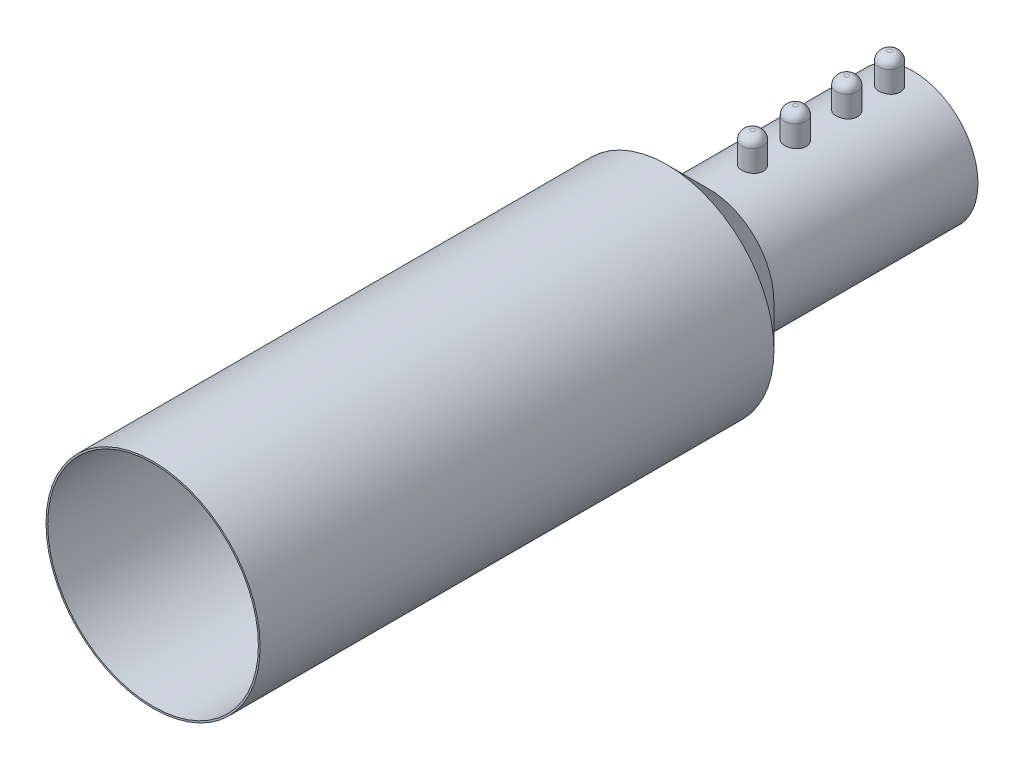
ISO-10303-21;
HEADER;
FILE_DESCRIPTION(('STEP AP214'),'2;1');
FILE_NAME('part.step','',(''),(''),'','','');
FILE_SCHEMA(('AUTOMOTIVE_DESIGN { 1 0 10303 214 1 1 1 1 }'));
ENDSEC;
DATA;
#1=APPLICATION_CONTEXT('core data for automotive mechanical design processes');
#2=APPLICATION_PROTOCOL_DEFINITION('international standard','automotive_design',2000,#1);
#3=PRODUCT_CONTEXT('',#1,'mechanical');
#4=PRODUCT('Part','Part','',(#3));
#5=PRODUCT_RELATED_PRODUCT_CATEGORY('part','',(#4));
#6=PRODUCT_DEFINITION_FORMATION('','',#4);
#7=PRODUCT_DEFINITION_CONTEXT('part definition',#1,'design');
#8=PRODUCT_DEFINITION('design','',#6,#7);
#9=PRODUCT_DEFINITION_SHAPE('','',#8);
#10=(LENGTH_UNIT() NAMED_UNIT(*) SI_UNIT(.MILLI.,.METRE.));
#11=(NAMED_UNIT(*) PLANE_ANGLE_UNIT() SI_UNIT($,.RADIAN.));
#12=(NAMED_UNIT(*) SI_UNIT($,.STERADIAN.) SOLID_ANGLE_UNIT());
#13=UNCERTAINTY_MEASURE_WITH_UNIT(LENGTH_MEASURE(1.E-05),#10,'distance_accuracy_value','');
#14=(GEOMETRIC_REPRESENTATION_CONTEXT(3) GLOBAL_UNCERTAINTY_ASSIGNED_CONTEXT((#13)) GLOBAL_UNIT_ASSIGNED_CONTEXT((#10,
#11,#12)) REPRESENTATION_CONTEXT('',''));
#15=CARTESIAN_POINT('',(0.,0.,0.));
#16=DIRECTION('',(0.,0.,1.));
#17=DIRECTION('',(1.,0.,0.));
#18=AXIS2_PLACEMENT_3D('',#15,#16,#17);
#19=CARTESIAN_POINT('',(0.,0.,76.2));
#20=DIRECTION('',(0.,0.,-1.));
#21=DIRECTION('',(-1.,0.,0.));
#22=AXIS2_PLACEMENT_3D('',#19,#20,#21);
#23=CYLINDRICAL_SURFACE('',#22,19.177);
#24=CARTESIAN_POINT('',(0.,0.,3.10688140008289));
#25=DIRECTION('',(0.,0.,1.));
#26=DIRECTION('',(1.,0.,0.));
#27=AXIS2_PLACEMENT_3D('',#24,#25,#26);
#28=CIRCLE('',#27,19.177);
#29=CARTESIAN_POINT('',(19.177,0.,3.10688140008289));
#30=VERTEX_POINT('',#29);
#31=EDGE_CURVE('E214',#30,#30,#28,.T.);
#32=ORIENTED_EDGE('',*,*,#31,.T.);
#33=EDGE_LOOP('',(#32));
#34=FACE_BOUND('',#33,.T.);
#35=CARTESIAN_POINT('',(0.,0.,63.6600000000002));
#36=DIRECTION('',(0.,0.,1.));
#37=DIRECTION('',(1.,0.,0.));
#38=AXIS2_PLACEMENT_3D('',#35,#36,#37);
#39=CIRCLE('',#38,19.177);
#40=CARTESIAN_POINT('',(19.177,0.,63.6600000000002));
#41=VERTEX_POINT('',#40);
#42=EDGE_CURVE('E217',#41,#41,#39,.F.);
#43=ORIENTED_EDGE('',*,*,#42,.T.);
#44=EDGE_LOOP('',(#43));
#45=FACE_BOUND('',#44,.T.);
#46=CARTESIAN_POINT('',(0.,19.177,6.985));
#47=CARTESIAN_POINT('',(-0.177043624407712,19.1769969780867,6.98500711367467));
#48=CARTESIAN_POINT('',(-0.354184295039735,19.1745227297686,6.999858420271));
#49=CARTESIAN_POINT('',(-0.70349856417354,19.1648907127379,7.05884722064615));
#50=CARTESIAN_POINT('',(-0.875667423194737,19.1577286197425,7.10301175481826));
#51=CARTESIAN_POINT('',(-1.20993356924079,19.1395243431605,7.21925796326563));
#52=CARTESIAN_POINT('',(-1.37203892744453,19.1284853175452,7.29131692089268));
#53=CARTESIAN_POINT('',(-1.681837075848,19.103741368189,7.461247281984));
#54=CARTESIAN_POINT('',(-1.82953153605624,19.0900367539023,7.55911568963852));
#55=CARTESIAN_POINT('',(-2.10773045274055,19.0613365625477,7.77886963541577));
#56=CARTESIAN_POINT('',(-2.23807914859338,19.0463310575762,7.9009510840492));
#57=CARTESIAN_POINT('',(-2.47654105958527,19.016796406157,8.1652439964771));
#58=CARTESIAN_POINT('',(-2.58465287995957,19.0022672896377,8.30745672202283));
#59=CARTESIAN_POINT('',(-2.7761951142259,18.9752342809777,8.60904362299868));
#60=CARTESIAN_POINT('',(-2.85947173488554,18.9627432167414,8.76851672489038));
#61=CARTESIAN_POINT('',(-2.99799621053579,18.94133816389,9.09942918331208));
#62=CARTESIAN_POINT('',(-3.05324593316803,18.9324239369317,9.27086774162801));
#63=CARTESIAN_POINT('',(-3.13365801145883,18.9192805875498,9.6191944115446));
#64=CARTESIAN_POINT('',(-3.15908911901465,18.9150096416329,9.79601887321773));
#65=CARTESIAN_POINT('',(-3.1799752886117,18.9115098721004,10.1514728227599));
#66=CARTESIAN_POINT('',(-3.17543244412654,18.912280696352,10.3301021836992));
#67=CARTESIAN_POINT('',(-3.13671862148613,18.9187391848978,10.6821781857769));
#68=CARTESIAN_POINT('',(-3.10284936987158,18.9243767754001,10.8556590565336));
#69=CARTESIAN_POINT('',(-3.0069175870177,18.9398552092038,11.1944414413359));
#70=CARTESIAN_POINT('',(-2.94485410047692,18.9496961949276,11.3597426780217));
#71=CARTESIAN_POINT('',(-2.79398914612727,18.9725267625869,11.6783777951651));
#72=CARTESIAN_POINT('',(-2.70506221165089,18.9855310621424,11.831651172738));
#73=CARTESIAN_POINT('',(-2.50308377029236,19.0132127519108,12.1212148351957));
#74=CARTESIAN_POINT('',(-2.39003034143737,19.0278902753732,12.2575037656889));
#75=CARTESIAN_POINT('',(-2.14136327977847,19.0574847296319,12.5109764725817));
#76=CARTESIAN_POINT('',(-2.00549073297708,19.072402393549,12.6279063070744));
#77=CARTESIAN_POINT('',(-1.71591849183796,19.1006303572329,12.8373452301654));
#78=CARTESIAN_POINT('',(-1.56221868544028,19.1139406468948,12.9298541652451));
#79=CARTESIAN_POINT('',(-1.24111742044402,19.1374726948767,13.0878477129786));
#80=CARTESIAN_POINT('',(-1.07370482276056,19.1476919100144,13.1533100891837));
#81=CARTESIAN_POINT('',(-0.730054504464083,19.1638698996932,13.2551176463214));
#82=CARTESIAN_POINT('',(-0.5538175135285,19.169829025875,13.2914652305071));
#83=CARTESIAN_POINT('',(-0.199710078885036,19.1767681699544,13.3336676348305));
#84=CARTESIAN_POINT('',(-0.0218822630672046,19.1778051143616,13.3398711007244));
#85=CARTESIAN_POINT('',(0.332272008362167,19.1749389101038,13.3225383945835));
#86=CARTESIAN_POINT('',(0.508598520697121,19.1710359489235,13.299003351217));
#87=CARTESIAN_POINT('',(0.853669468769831,19.1587637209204,13.223151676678));
#88=CARTESIAN_POINT('',(1.02245283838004,19.1504212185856,13.1710074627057));
#89=CARTESIAN_POINT('',(1.34888190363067,19.1302016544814,13.0396012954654));
#90=CARTESIAN_POINT('',(1.50652698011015,19.1183243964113,12.9603378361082));
#91=CARTESIAN_POINT('',(1.80772017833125,19.0922118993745,12.7761433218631));
#92=CARTESIAN_POINT('',(1.95113323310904,19.0779569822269,12.6709942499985));
#93=CARTESIAN_POINT('',(2.21840290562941,19.0487303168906,12.4383134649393));
#94=CARTESIAN_POINT('',(2.34225812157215,19.0337585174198,12.3107801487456));
#95=CARTESIAN_POINT('',(2.56818702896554,19.0046016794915,12.0353882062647));
#96=CARTESIAN_POINT('',(2.67002528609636,18.9904262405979,11.8873352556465));
#97=CARTESIAN_POINT('',(2.84738573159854,18.9646457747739,11.5760189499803));
#98=CARTESIAN_POINT('',(2.9229087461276,18.9530406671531,11.4127560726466));
#99=CARTESIAN_POINT('',(3.04514188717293,18.9337866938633,11.0763156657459));
#100=CARTESIAN_POINT('',(3.09196966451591,18.9261216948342,10.9031818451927));
#101=CARTESIAN_POINT('',(3.15585358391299,18.9155751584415,10.5513685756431));
#102=CARTESIAN_POINT('',(3.17291227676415,18.9126932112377,10.3726896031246));
#103=CARTESIAN_POINT('',(3.17670337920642,18.9120565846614,10.0172087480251));
#104=CARTESIAN_POINT('',(3.16380634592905,18.9142392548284,9.84041082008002));
#105=CARTESIAN_POINT('',(3.10885286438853,18.9233487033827,9.49153734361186));
#106=CARTESIAN_POINT('',(3.06679650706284,18.9302754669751,9.31946178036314));
#107=CARTESIAN_POINT('',(2.95485941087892,18.9480689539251,8.98505811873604));
#108=CARTESIAN_POINT('',(2.88501016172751,18.9589312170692,8.82271922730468));
#109=CARTESIAN_POINT('',(2.7195080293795,18.9833761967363,8.51200426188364));
#110=CARTESIAN_POINT('',(2.62385389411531,18.9969590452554,8.36362886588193));
#111=CARTESIAN_POINT('',(2.40813313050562,19.0255135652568,8.08317983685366));
#112=CARTESIAN_POINT('',(2.28779375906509,19.040499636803,7.95131743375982));
#113=CARTESIAN_POINT('',(2.026693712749,19.0700568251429,7.70953051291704));
#114=CARTESIAN_POINT('',(1.88592832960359,19.0846278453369,7.59961106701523));
#115=CARTESIAN_POINT('',(1.58683415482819,19.1118279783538,7.40414756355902));
#116=CARTESIAN_POINT('',(1.42839234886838,19.1244431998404,7.31877449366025));
#117=CARTESIAN_POINT('',(1.09927295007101,19.1461750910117,7.17598660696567));
#118=CARTESIAN_POINT('',(0.928607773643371,19.1552952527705,7.11854386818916));
#119=CARTESIAN_POINT('',(0.631060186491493,19.167012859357,7.0457542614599));
#120=CARTESIAN_POINT('',(0.505980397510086,19.1707380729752,7.02300778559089));
#121=CARTESIAN_POINT('',(0.25395036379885,19.1757327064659,6.9926282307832));
#122=CARTESIAN_POINT('',(0.127000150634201,19.1770021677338,6.98499489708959));
#123=CARTESIAN_POINT('',(0.,19.177,6.985));
#124=B_SPLINE_CURVE_WITH_KNOTS('',3,(#46,#47,#48,#49,#50,#51,#52,#53,#54,#55,#56,#57,#58,#59,
#60,#61,#62,#63,#64,#65,#66,#67,#68,#69,#70,#71,#72,#73,#74,#75,#76,#77,#78,#79,#80,#81,#82,#83,
#84,#85,#86,#87,#88,#89,#90,#91,#92,#93,#94,#95,#96,#97,#98,#99,#100,#101,#102,#103,#104,#105,
#106,#107,#108,#109,#110,#111,#112,#113,#114,#115,#116,#117,#118,#119,#120,#121,#122,#123),
.UNSPECIFIED.,.T.,.F.,(4,2,2,2,2,2,2,2,2,2,2,2,2,2,2,2,2,2,2,2,2,2,2,2,2,2,2,2,2,2,2,2,2,2,2,2,
2,2,4),(0.,0.530666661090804,1.06182352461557,1.592548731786,2.12321236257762,2.6583590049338,
3.19353920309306,3.73196781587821,4.27036054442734,4.80386256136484,5.33732731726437,
5.86536783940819,6.39342625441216,6.92399015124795,7.45459632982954,7.99168947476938,
8.52878599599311,9.06632321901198,9.60381606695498,10.1350772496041,10.6663182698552,
11.1943923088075,11.7224956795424,12.2552089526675,12.7879603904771,13.3261541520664,
13.8643310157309,14.4002863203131,14.9361956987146,15.4655111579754,15.9948249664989,
16.5235407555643,17.0522822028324,17.5872149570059,18.12227121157,18.6609689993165,
19.1991271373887,19.5798010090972,19.9604684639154),.UNSPECIFIED.);
#125=CARTESIAN_POINT('',(0.,19.177,6.985));
#126=VERTEX_POINT('',#125);
#127=EDGE_CURVE('E128',#126,#126,#124,.T.);
#128=ORIENTED_EDGE('',*,*,#127,.F.);
#129=EDGE_LOOP('',(#128));
#130=FACE_BOUND('',#129,.T.);
#131=CARTESIAN_POINT('',(0.,19.177,19.685));
#132=CARTESIAN_POINT('',(-0.177043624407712,19.1769969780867,19.6850071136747));
#133=CARTESIAN_POINT('',(-0.354184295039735,19.1745227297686,19.699858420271));
#134=CARTESIAN_POINT('',(-0.703498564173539,19.1648907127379,19.7588472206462));
#135=CARTESIAN_POINT('',(-0.875667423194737,19.1577286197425,19.8030117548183));
#136=CARTESIAN_POINT('',(-1.20993356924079,19.1395243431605,19.9192579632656));
#137=CARTESIAN_POINT('',(-1.37203892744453,19.1284853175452,19.9913169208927));
#138=CARTESIAN_POINT('',(-1.681837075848,19.103741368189,20.161247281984));
#139=CARTESIAN_POINT('',(-1.82953153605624,19.0900367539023,20.2591156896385));
#140=CARTESIAN_POINT('',(-2.10773045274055,19.0613365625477,20.4788696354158));
#141=CARTESIAN_POINT('',(-2.23807914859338,19.0463310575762,20.6009510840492));
#142=CARTESIAN_POINT('',(-2.47654105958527,19.016796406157,20.8652439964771));
#143=CARTESIAN_POINT('',(-2.58465287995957,19.0022672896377,21.0074567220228));
#144=CARTESIAN_POINT('',(-2.7761951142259,18.9752342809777,21.3090436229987));
#145=CARTESIAN_POINT('',(-2.85947173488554,18.9627432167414,21.4685167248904));
#146=CARTESIAN_POINT('',(-2.99799621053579,18.94133816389,21.7994291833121));
#147=CARTESIAN_POINT('',(-3.05324593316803,18.9324239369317,21.970867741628));
#148=CARTESIAN_POINT('',(-3.13365801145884,18.9192805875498,22.3191944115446));
#149=CARTESIAN_POINT('',(-3.15908911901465,18.9150096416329,22.4960188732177));
#150=CARTESIAN_POINT('',(-3.1799752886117,18.9115098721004,22.8514728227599));
#151=CARTESIAN_POINT('',(-3.17543244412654,18.912280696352,23.0301021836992));
#152=CARTESIAN_POINT('',(-3.13671862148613,18.9187391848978,23.3821781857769));
#153=CARTESIAN_POINT('',(-3.10284936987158,18.9243767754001,23.5556590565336));
#154=CARTESIAN_POINT('',(-3.0069175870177,18.9398552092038,23.8944414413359));
#155=CARTESIAN_POINT('',(-2.94485410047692,18.9496961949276,24.0597426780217));
#156=CARTESIAN_POINT('',(-2.79398914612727,18.9725267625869,24.3783777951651));
#157=CARTESIAN_POINT('',(-2.70506221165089,18.9855310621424,24.531651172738));
#158=CARTESIAN_POINT('',(-2.50308377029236,19.0132127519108,24.8212148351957));
#159=CARTESIAN_POINT('',(-2.39003034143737,19.0278902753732,24.9575037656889));
#160=CARTESIAN_POINT('',(-2.14136327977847,19.0574847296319,25.2109764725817));
#161=CARTESIAN_POINT('',(-2.00549073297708,19.072402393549,25.3279063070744));
#162=CARTESIAN_POINT('',(-1.71591849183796,19.1006303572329,25.5373452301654));
#163=CARTESIAN_POINT('',(-1.56221868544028,19.1139406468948,25.6298541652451));
#164=CARTESIAN_POINT('',(-1.24111742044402,19.1374726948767,25.7878477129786));
#165=CARTESIAN_POINT('',(-1.07370482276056,19.1476919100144,25.8533100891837));
#166=CARTESIAN_POINT('',(-0.730054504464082,19.1638698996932,25.9551176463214));
#167=CARTESIAN_POINT('',(-0.553817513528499,19.169829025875,25.9914652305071));
#168=CARTESIAN_POINT('',(-0.199710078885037,19.1767681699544,26.0336676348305));
#169=CARTESIAN_POINT('',(-0.0218822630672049,19.1778051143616,26.0398711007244));
#170=CARTESIAN_POINT('',(0.332272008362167,19.1749389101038,26.0225383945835));
#171=CARTESIAN_POINT('',(0.508598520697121,19.1710359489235,25.999003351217));
#172=CARTESIAN_POINT('',(0.85366946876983,19.1587637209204,25.923151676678));
#173=CARTESIAN_POINT('',(1.02245283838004,19.1504212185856,25.8710074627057));
#174=CARTESIAN_POINT('',(1.34888190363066,19.1302016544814,25.7396012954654));
#175=CARTESIAN_POINT('',(1.50652698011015,19.1183243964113,25.6603378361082));
#176=CARTESIAN_POINT('',(1.80772017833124,19.0922118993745,25.4761433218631));
#177=CARTESIAN_POINT('',(1.95113323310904,19.0779569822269,25.3709942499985));
#178=CARTESIAN_POINT('',(2.2184029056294,19.0487303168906,25.1383134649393));
#179=CARTESIAN_POINT('',(2.34225812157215,19.0337585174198,25.0107801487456));
#180=CARTESIAN_POINT('',(2.56818702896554,19.0046016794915,24.7353882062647));
#181=CARTESIAN_POINT('',(2.67002528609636,18.9904262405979,24.5873352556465));
#182=CARTESIAN_POINT('',(2.84738573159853,18.9646457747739,24.2760189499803));
#183=CARTESIAN_POINT('',(2.9229087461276,18.9530406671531,24.1127560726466));
#184=CARTESIAN_POINT('',(3.04514188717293,18.9337866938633,23.7763156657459));
#185=CARTESIAN_POINT('',(3.09196966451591,18.9261216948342,23.6031818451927));
#186=CARTESIAN_POINT('',(3.15585358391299,18.9155751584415,23.2513685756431));
#187=CARTESIAN_POINT('',(3.17291227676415,18.9126932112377,23.0726896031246));
#188=CARTESIAN_POINT('',(3.17670337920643,18.9120565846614,22.7172087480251));
#189=CARTESIAN_POINT('',(3.16380634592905,18.9142392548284,22.54041082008));
#190=CARTESIAN_POINT('',(3.10885286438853,18.9233487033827,22.1915373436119));
#191=CARTESIAN_POINT('',(3.06679650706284,18.9302754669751,22.0194617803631));
#192=CARTESIAN_POINT('',(2.95485941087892,18.9480689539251,21.685058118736));
#193=CARTESIAN_POINT('',(2.88501016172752,18.9589312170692,21.5227192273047));
#194=CARTESIAN_POINT('',(2.7195080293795,18.9833761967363,21.2120042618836));
#195=CARTESIAN_POINT('',(2.62385389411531,18.9969590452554,21.0636288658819));
#196=CARTESIAN_POINT('',(2.40813313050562,19.0255135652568,20.7831798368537));
#197=CARTESIAN_POINT('',(2.28779375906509,19.040499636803,20.6513174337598));
#198=CARTESIAN_POINT('',(2.026693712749,19.0700568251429,20.409530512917));
#199=CARTESIAN_POINT('',(1.88592832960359,19.0846278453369,20.2996110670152));
#200=CARTESIAN_POINT('',(1.58683415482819,19.1118279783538,20.104147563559));
#201=CARTESIAN_POINT('',(1.42839234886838,19.1244431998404,20.0187744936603));
#202=CARTESIAN_POINT('',(1.09927295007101,19.1461750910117,19.8759866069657));
#203=CARTESIAN_POINT('',(0.928607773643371,19.1552952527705,19.8185438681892));
#204=CARTESIAN_POINT('',(0.631060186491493,19.167012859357,19.7457542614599));
#205=CARTESIAN_POINT('',(0.505980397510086,19.1707380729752,19.7230077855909));
#206=CARTESIAN_POINT('',(0.253950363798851,19.1757327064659,19.6926282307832));
#207=CARTESIAN_POINT('',(0.127000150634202,19.1770021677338,19.6849948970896));
#208=CARTESIAN_POINT('',(0.,19.177,19.685));
#209=B_SPLINE_CURVE_WITH_KNOTS('',3,(#131,#132,#133,#134,#135,#136,#137,#138,#139,#140,#141,
#142,#143,#144,#145,#146,#147,#148,#149,#150,#151,#152,#153,#154,#155,#156,#157,#158,#159,#160,
#161,#162,#163,#164,#165,#166,#167,#168,#169,#170,#171,#172,#173,#174,#175,#176,#177,#178,#179,
#180,#181,#182,#183,#184,#185,#186,#187,#188,#189,#190,#191,#192,#193,#194,#195,#196,#197,#198,
#199,#200,#201,#202,#203,#204,#205,#206,#207,#208),.UNSPECIFIED.,.T.,.F.,(4,2,2,2,2,2,2,2,2,2,2,
2,2,2,2,2,2,2,2,2,2,2,2,2,2,2,2,2,2,2,2,2,2,2,2,2,2,2,4),(0.,0.530666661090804,1.06182352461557,
1.592548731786,2.12321236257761,2.6583590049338,3.19353920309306,3.73196781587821,
4.27036054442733,4.80386256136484,5.33732731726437,5.86536783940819,6.39342625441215,
6.92399015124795,7.45459632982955,7.99168947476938,8.52878599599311,9.06632321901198,
9.60381606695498,10.1350772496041,10.6663182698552,11.1943923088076,11.7224956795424,
12.2552089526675,12.7879603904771,13.3261541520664,13.8643310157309,14.4002863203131,
14.9361956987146,15.4655111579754,15.9948249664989,16.5235407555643,17.0522822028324,
17.5872149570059,18.12227121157,18.6609689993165,19.1991271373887,19.5798010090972,
19.9604684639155),.UNSPECIFIED.);
#210=CARTESIAN_POINT('',(0.,19.177,19.685));
#211=VERTEX_POINT('',#210);
#212=EDGE_CURVE('E136',#211,#211,#209,.T.);
#213=ORIENTED_EDGE('',*,*,#212,.F.);
#214=EDGE_LOOP('',(#213));
#215=FACE_BOUND('',#214,.T.);
#216=CARTESIAN_POINT('',(0.,19.177,34.925));
#217=CARTESIAN_POINT('',(-0.177043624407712,19.1769969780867,34.9250071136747));
#218=CARTESIAN_POINT('',(-0.354184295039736,19.1745227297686,34.939858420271));
#219=CARTESIAN_POINT('',(-0.70349856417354,19.1648907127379,34.9988472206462));
#220=CARTESIAN_POINT('',(-0.875667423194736,19.1577286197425,35.0430117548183));
#221=CARTESIAN_POINT('',(-1.20993356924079,19.1395243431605,35.1592579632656));
#222=CARTESIAN_POINT('',(-1.37203892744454,19.1284853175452,35.2313169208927));
#223=CARTESIAN_POINT('',(-1.681837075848,19.103741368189,35.401247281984));
#224=CARTESIAN_POINT('',(-1.82953153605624,19.0900367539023,35.4991156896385));
#225=CARTESIAN_POINT('',(-2.10773045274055,19.0613365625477,35.7188696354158));
#226=CARTESIAN_POINT('',(-2.23807914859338,19.0463310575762,35.8409510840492));
#227=CARTESIAN_POINT('',(-2.47654105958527,19.016796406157,36.1052439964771));
#228=CARTESIAN_POINT('',(-2.58465287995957,19.0022672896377,36.2474567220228));
#229=CARTESIAN_POINT('',(-2.7761951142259,18.9752342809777,36.5490436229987));
#230=CARTESIAN_POINT('',(-2.85947173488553,18.9627432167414,36.7085167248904));
#231=CARTESIAN_POINT('',(-2.99799621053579,18.94133816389,37.0394291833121));
#232=CARTESIAN_POINT('',(-3.05324593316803,18.9324239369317,37.210867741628));
#233=CARTESIAN_POINT('',(-3.13365801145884,18.9192805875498,37.5591944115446));
#234=CARTESIAN_POINT('',(-3.15908911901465,18.9150096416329,37.7360188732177));
#235=CARTESIAN_POINT('',(-3.1799752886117,18.9115098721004,38.0914728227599));
#236=CARTESIAN_POINT('',(-3.17543244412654,18.912280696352,38.2701021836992));
#237=CARTESIAN_POINT('',(-3.13671862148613,18.9187391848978,38.6221781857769));
#238=CARTESIAN_POINT('',(-3.10284936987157,18.9243767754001,38.7956590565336));
#239=CARTESIAN_POINT('',(-3.0069175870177,18.9398552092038,39.134441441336));
#240=CARTESIAN_POINT('',(-2.94485410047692,18.9496961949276,39.2997426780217));
#241=CARTESIAN_POINT('',(-2.79398914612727,18.9725267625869,39.6183777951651));
#242=CARTESIAN_POINT('',(-2.70506221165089,18.9855310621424,39.771651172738));
#243=CARTESIAN_POINT('',(-2.50308377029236,19.0132127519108,40.0612148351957));
#244=CARTESIAN_POINT('',(-2.39003034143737,19.0278902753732,40.1975037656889));
#245=CARTESIAN_POINT('',(-2.14136327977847,19.0574847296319,40.4509764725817));
#246=CARTESIAN_POINT('',(-2.00549073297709,19.072402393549,40.5679063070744));
#247=CARTESIAN_POINT('',(-1.71591849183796,19.1006303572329,40.7773452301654));
#248=CARTESIAN_POINT('',(-1.56221868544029,19.1139406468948,40.8698541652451));
#249=CARTESIAN_POINT('',(-1.24111742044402,19.1374726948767,41.0278477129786));
#250=CARTESIAN_POINT('',(-1.07370482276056,19.1476919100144,41.0933100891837));
#251=CARTESIAN_POINT('',(-0.730054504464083,19.1638698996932,41.1951176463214));
#252=CARTESIAN_POINT('',(-0.553817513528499,19.169829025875,41.2314652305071));
#253=CARTESIAN_POINT('',(-0.199710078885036,19.1767681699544,41.2736676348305));
#254=CARTESIAN_POINT('',(-0.0218822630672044,19.1778051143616,41.2798711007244));
#255=CARTESIAN_POINT('',(0.332272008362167,19.1749389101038,41.2625383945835));
#256=CARTESIAN_POINT('',(0.508598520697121,19.1710359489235,41.239003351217));
#257=CARTESIAN_POINT('',(0.853669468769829,19.1587637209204,41.163151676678));
#258=CARTESIAN_POINT('',(1.02245283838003,19.1504212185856,41.1110074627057));
#259=CARTESIAN_POINT('',(1.34888190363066,19.1302016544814,40.9796012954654));
#260=CARTESIAN_POINT('',(1.50652698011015,19.1183243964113,40.9003378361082));
#261=CARTESIAN_POINT('',(1.80772017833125,19.0922118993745,40.7161433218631));
#262=CARTESIAN_POINT('',(1.95113323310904,19.0779569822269,40.6109942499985));
#263=CARTESIAN_POINT('',(2.21840290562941,19.0487303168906,40.3783134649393));
#264=CARTESIAN_POINT('',(2.34225812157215,19.0337585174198,40.2507801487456));
#265=CARTESIAN_POINT('',(2.56818702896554,19.0046016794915,39.9753882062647));
#266=CARTESIAN_POINT('',(2.67002528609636,18.9904262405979,39.8273352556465));
#267=CARTESIAN_POINT('',(2.84738573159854,18.9646457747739,39.5160189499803));
#268=CARTESIAN_POINT('',(2.9229087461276,18.9530406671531,39.3527560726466));
#269=CARTESIAN_POINT('',(3.04514188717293,18.9337866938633,39.0163156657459));
#270=CARTESIAN_POINT('',(3.09196966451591,18.9261216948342,38.8431818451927));
#271=CARTESIAN_POINT('',(3.15585358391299,18.9155751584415,38.4913685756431));
#272=CARTESIAN_POINT('',(3.17291227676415,18.9126932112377,38.3126896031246));
#273=CARTESIAN_POINT('',(3.17670337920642,18.9120565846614,37.9572087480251));
#274=CARTESIAN_POINT('',(3.16380634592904,18.9142392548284,37.78041082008));
#275=CARTESIAN_POINT('',(3.10885286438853,18.9233487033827,37.4315373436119));
#276=CARTESIAN_POINT('',(3.06679650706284,18.9302754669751,37.2594617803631));
#277=CARTESIAN_POINT('',(2.95485941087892,18.9480689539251,36.925058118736));
#278=CARTESIAN_POINT('',(2.88501016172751,18.9589312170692,36.7627192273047));
#279=CARTESIAN_POINT('',(2.7195080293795,18.9833761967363,36.4520042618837));
#280=CARTESIAN_POINT('',(2.62385389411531,18.9969590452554,36.3036288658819));
#281=CARTESIAN_POINT('',(2.40813313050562,19.0255135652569,36.0231798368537));
#282=CARTESIAN_POINT('',(2.28779375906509,19.040499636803,35.8913174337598));
#283=CARTESIAN_POINT('',(2.026693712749,19.0700568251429,35.649530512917));
#284=CARTESIAN_POINT('',(1.88592832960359,19.0846278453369,35.5396110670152));
#285=CARTESIAN_POINT('',(1.58683415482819,19.1118279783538,35.344147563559));
#286=CARTESIAN_POINT('',(1.42839234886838,19.1244431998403,35.2587744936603));
#287=CARTESIAN_POINT('',(1.09927295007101,19.1461750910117,35.1159866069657));
#288=CARTESIAN_POINT('',(0.928607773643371,19.1552952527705,35.0585438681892));
#289=CARTESIAN_POINT('',(0.631060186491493,19.167012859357,34.9857542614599));
#290=CARTESIAN_POINT('',(0.505980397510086,19.1707380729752,34.9630077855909));
#291=CARTESIAN_POINT('',(0.253950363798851,19.1757327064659,34.9326282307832));
#292=CARTESIAN_POINT('',(0.127000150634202,19.1770021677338,34.9249948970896));
#293=CARTESIAN_POINT('',(0.,19.177,34.925));
#294=B_SPLINE_CURVE_WITH_KNOTS('',3,(#216,#217,#218,#219,#220,#221,#222,#223,#224,#225,#226,
#227,#228,#229,#230,#231,#232,#233,#234,#235,#236,#237,#238,#239,#240,#241,#242,#243,#244,#245,
#246,#247,#248,#249,#250,#251,#252,#253,#254,#255,#256,#257,#258,#259,#260,#261,#262,#263,#264,
#265,#266,#267,#268,#269,#270,#271,#272,#273,#274,#275,#276,#277,#278,#279,#280,#281,#282,#283,
#284,#285,#286,#287,#288,#289,#290,#291,#292,#293),.UNSPECIFIED.,.T.,.F.,(4,2,2,2,2,2,2,2,2,2,2,
2,2,2,2,2,2,2,2,2,2,2,2,2,2,2,2,2,2,2,2,2,2,2,2,2,2,2,4),(0.,0.530666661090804,1.06182352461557,
1.59254873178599,2.12321236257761,2.6583590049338,3.19353920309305,3.73196781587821,
4.27036054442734,4.80386256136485,5.33732731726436,5.86536783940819,6.39342625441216,
6.92399015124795,7.45459632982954,7.99168947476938,8.52878599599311,9.06632321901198,
9.60381606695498,10.1350772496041,10.6663182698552,11.1943923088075,11.7224956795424,
12.2552089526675,12.7879603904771,13.3261541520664,13.8643310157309,14.4002863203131,
14.9361956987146,15.4655111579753,15.9948249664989,16.5235407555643,17.0522822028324,
17.5872149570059,18.12227121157,18.6609689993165,19.1991271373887,19.5798010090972,
19.9604684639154),.UNSPECIFIED.);
#295=CARTESIAN_POINT('',(0.,19.177,34.925));
#296=VERTEX_POINT('',#295);
#297=EDGE_CURVE('E114',#296,#296,#294,.T.);
#298=ORIENTED_EDGE('',*,*,#297,.F.);
#299=EDGE_LOOP('',(#298));
#300=FACE_BOUND('',#299,.T.);
#301=CARTESIAN_POINT('',(0.,19.177,47.625));
#302=CARTESIAN_POINT('',(-0.177043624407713,19.1769969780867,47.6250071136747));
#303=CARTESIAN_POINT('',(-0.354184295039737,19.1745227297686,47.639858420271));
#304=CARTESIAN_POINT('',(-0.703498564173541,19.1648907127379,47.6988472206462));
#305=CARTESIAN_POINT('',(-0.875667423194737,19.1577286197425,47.7430117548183));
#306=CARTESIAN_POINT('',(-1.20993356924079,19.1395243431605,47.8592579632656));
#307=CARTESIAN_POINT('',(-1.37203892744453,19.1284853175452,47.9313169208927));
#308=CARTESIAN_POINT('',(-1.681837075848,19.103741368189,48.101247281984));
#309=CARTESIAN_POINT('',(-1.82953153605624,19.0900367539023,48.1991156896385));
#310=CARTESIAN_POINT('',(-2.10773045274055,19.0613365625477,48.4188696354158));
#311=CARTESIAN_POINT('',(-2.23807914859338,19.0463310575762,48.5409510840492));
#312=CARTESIAN_POINT('',(-2.47654105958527,19.016796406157,48.8052439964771));
#313=CARTESIAN_POINT('',(-2.58465287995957,19.0022672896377,48.9474567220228));
#314=CARTESIAN_POINT('',(-2.7761951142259,18.9752342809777,49.2490436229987));
#315=CARTESIAN_POINT('',(-2.85947173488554,18.9627432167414,49.4085167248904));
#316=CARTESIAN_POINT('',(-2.99799621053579,18.94133816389,49.7394291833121));
#317=CARTESIAN_POINT('',(-3.05324593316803,18.9324239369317,49.910867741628));
#318=CARTESIAN_POINT('',(-3.13365801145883,18.9192805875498,50.2591944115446));
#319=CARTESIAN_POINT('',(-3.15908911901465,18.9150096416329,50.4360188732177));
#320=CARTESIAN_POINT('',(-3.1799752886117,18.9115098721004,50.7914728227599));
#321=CARTESIAN_POINT('',(-3.17543244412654,18.912280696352,50.9701021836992));
#322=CARTESIAN_POINT('',(-3.13671862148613,18.9187391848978,51.3221781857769));
#323=CARTESIAN_POINT('',(-3.10284936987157,18.9243767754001,51.4956590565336));
#324=CARTESIAN_POINT('',(-3.0069175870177,18.9398552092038,51.8344414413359));
#325=CARTESIAN_POINT('',(-2.94485410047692,18.9496961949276,51.9997426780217));
#326=CARTESIAN_POINT('',(-2.79398914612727,18.9725267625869,52.318377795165));
#327=CARTESIAN_POINT('',(-2.70506221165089,18.9855310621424,52.471651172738));
#328=CARTESIAN_POINT('',(-2.50308377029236,19.0132127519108,52.7612148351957));
#329=CARTESIAN_POINT('',(-2.39003034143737,19.0278902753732,52.8975037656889));
#330=CARTESIAN_POINT('',(-2.14136327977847,19.0574847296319,53.1509764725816));
#331=CARTESIAN_POINT('',(-2.00549073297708,19.072402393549,53.2679063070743));
#332=CARTESIAN_POINT('',(-1.71591849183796,19.1006303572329,53.4773452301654));
#333=CARTESIAN_POINT('',(-1.56221868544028,19.1139406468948,53.5698541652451));
#334=CARTESIAN_POINT('',(-1.24111742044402,19.1374726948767,53.7278477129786));
#335=CARTESIAN_POINT('',(-1.07370482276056,19.1476919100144,53.7933100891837));
#336=CARTESIAN_POINT('',(-0.730054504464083,19.1638698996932,53.8951176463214));
#337=CARTESIAN_POINT('',(-0.553817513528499,19.169829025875,53.9314652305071));
#338=CARTESIAN_POINT('',(-0.199710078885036,19.1767681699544,53.9736676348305));
#339=CARTESIAN_POINT('',(-0.0218822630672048,19.1778051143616,53.9798711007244));
#340=CARTESIAN_POINT('',(0.332272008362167,19.1749389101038,53.9625383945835));
#341=CARTESIAN_POINT('',(0.508598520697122,19.1710359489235,53.939003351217));
#342=CARTESIAN_POINT('',(0.853669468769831,19.1587637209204,53.863151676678));
#343=CARTESIAN_POINT('',(1.02245283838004,19.1504212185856,53.8110074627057));
#344=CARTESIAN_POINT('',(1.34888190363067,19.1302016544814,53.6796012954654));
#345=CARTESIAN_POINT('',(1.50652698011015,19.1183243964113,53.6003378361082));
#346=CARTESIAN_POINT('',(1.80772017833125,19.0922118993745,53.4161433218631));
#347=CARTESIAN_POINT('',(1.95113323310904,19.0779569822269,53.3109942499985));
#348=CARTESIAN_POINT('',(2.21840290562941,19.0487303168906,53.0783134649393));
#349=CARTESIAN_POINT('',(2.34225812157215,19.0337585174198,52.9507801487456));
#350=CARTESIAN_POINT('',(2.56818702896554,19.0046016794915,52.6753882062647));
#351=CARTESIAN_POINT('',(2.67002528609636,18.9904262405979,52.5273352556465));
#352=CARTESIAN_POINT('',(2.84738573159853,18.9646457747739,52.2160189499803));
#353=CARTESIAN_POINT('',(2.9229087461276,18.9530406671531,52.0527560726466));
#354=CARTESIAN_POINT('',(3.04514188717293,18.9337866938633,51.7163156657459));
#355=CARTESIAN_POINT('',(3.09196966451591,18.9261216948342,51.5431818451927));
#356=CARTESIAN_POINT('',(3.15585358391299,18.9155751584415,51.1913685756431));
#357=CARTESIAN_POINT('',(3.17291227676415,18.9126932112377,51.0126896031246));
#358=CARTESIAN_POINT('',(3.17670337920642,18.9120565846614,50.6572087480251));
#359=CARTESIAN_POINT('',(3.16380634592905,18.9142392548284,50.48041082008));
#360=CARTESIAN_POINT('',(3.10885286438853,18.9233487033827,50.1315373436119));
#361=CARTESIAN_POINT('',(3.06679650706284,18.9302754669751,49.9594617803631));
#362=CARTESIAN_POINT('',(2.95485941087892,18.9480689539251,49.625058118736));
#363=CARTESIAN_POINT('',(2.88501016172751,18.9589312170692,49.4627192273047));
#364=CARTESIAN_POINT('',(2.7195080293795,18.9833761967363,49.1520042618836));
#365=CARTESIAN_POINT('',(2.62385389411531,18.9969590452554,49.0036288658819));
#366=CARTESIAN_POINT('',(2.40813313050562,19.0255135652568,48.7231798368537));
#367=CARTESIAN_POINT('',(2.28779375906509,19.040499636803,48.5913174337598));
#368=CARTESIAN_POINT('',(2.026693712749,19.0700568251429,48.349530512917));
#369=CARTESIAN_POINT('',(1.88592832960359,19.0846278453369,48.2396110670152));
#370=CARTESIAN_POINT('',(1.58683415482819,19.1118279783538,48.044147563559));
#371=CARTESIAN_POINT('',(1.42839234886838,19.1244431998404,47.9587744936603));
#372=CARTESIAN_POINT('',(1.09927295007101,19.1461750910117,47.8159866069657));
#373=CARTESIAN_POINT('',(0.928607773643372,19.1552952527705,47.7585438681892));
#374=CARTESIAN_POINT('',(0.631060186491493,19.167012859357,47.6857542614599));
#375=CARTESIAN_POINT('',(0.505980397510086,19.1707380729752,47.6630077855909));
#376=CARTESIAN_POINT('',(0.253950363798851,19.1757327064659,47.6326282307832));
#377=CARTESIAN_POINT('',(0.127000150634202,19.1770021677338,47.6249948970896));
#378=CARTESIAN_POINT('',(0.,19.177,47.625));
#379=B_SPLINE_CURVE_WITH_KNOTS('',3,(#301,#302,#303,#304,#305,#306,#307,#308,#309,#310,#311,
#312,#313,#314,#315,#316,#317,#318,#319,#320,#321,#322,#323,#324,#325,#326,#327,#328,#329,#330,
#331,#332,#333,#334,#335,#336,#337,#338,#339,#340,#341,#342,#343,#344,#345,#346,#347,#348,#349,
#350,#351,#352,#353,#354,#355,#356,#357,#358,#359,#360,#361,#362,#363,#364,#365,#366,#367,#368,
#369,#370,#371,#372,#373,#374,#375,#376,#377,#378),.UNSPECIFIED.,.T.,.F.,(4,2,2,2,2,2,2,2,2,2,2,
2,2,2,2,2,2,2,2,2,2,2,2,2,2,2,2,2,2,2,2,2,2,2,2,2,2,2,4),(0.,0.530666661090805,1.06182352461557,
1.592548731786,2.12321236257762,2.6583590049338,3.19353920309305,3.73196781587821,
4.27036054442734,4.80386256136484,5.33732731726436,5.86536783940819,6.39342625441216,
6.92399015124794,7.45459632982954,7.99168947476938,8.52878599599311,9.06632321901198,
9.60381606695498,10.1350772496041,10.6663182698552,11.1943923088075,11.7224956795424,
12.2552089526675,12.7879603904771,13.3261541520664,13.8643310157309,14.4002863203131,
14.9361956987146,15.4655111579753,15.9948249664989,16.5235407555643,17.0522822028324,
17.5872149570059,18.12227121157,18.6609689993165,19.1991271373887,19.5798010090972,
19.9604684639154),.UNSPECIFIED.);
#380=CARTESIAN_POINT('',(0.,19.177,47.625));
#381=VERTEX_POINT('',#380);
#382=EDGE_CURVE('E76',#381,#381,#379,.T.);
#383=ORIENTED_EDGE('',*,*,#382,.F.);
#384=EDGE_LOOP('',(#383));
#385=FACE_BOUND('',#384,.T.);
#386=ADVANCED_FACE('F44',(#34,#45,#130,#215,#300,#385),#23,.T.);
#387=CARTESIAN_POINT('',(0.,0.,76.2));
#388=DIRECTION('',(0.,0.,-1.));
#389=DIRECTION('',(-1.,0.,0.));
#390=AXIS2_PLACEMENT_3D('',#387,#388,#389);
#391=CYLINDRICAL_SURFACE('',#390,18.669);
#392=CARTESIAN_POINT('',(0.,18.669,34.925));
#393=CARTESIAN_POINT('',(-0.176972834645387,18.6689969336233,34.9250070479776));
#394=CARTESIAN_POINT('',(-0.354040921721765,18.6664574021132,34.9398465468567));
#395=CARTESIAN_POINT('',(-0.703207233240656,18.6565712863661,34.9987856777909));
#396=CARTESIAN_POINT('',(-0.875300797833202,18.6492203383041,35.0429118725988));
#397=CARTESIAN_POINT('',(-1.20941614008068,18.6305355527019,35.1590505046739));
#398=CARTESIAN_POINT('',(-1.37144616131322,18.619205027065,35.2310397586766));
#399=CARTESIAN_POINT('',(-1.68110780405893,18.5938055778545,35.4007994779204));
#400=CARTESIAN_POINT('',(-1.82874099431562,18.5797369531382,35.4985671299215));
#401=CARTESIAN_POINT('',(-2.10690504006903,18.5502635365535,35.7181415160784));
#402=CARTESIAN_POINT('',(-2.23727208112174,18.5348479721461,35.84015435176));
#403=CARTESIAN_POINT('',(-2.47578781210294,18.5045001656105,36.1043120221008));
#404=CARTESIAN_POINT('',(-2.58393507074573,18.4895679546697,36.2464581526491));
#405=CARTESIAN_POINT('',(-2.7756017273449,18.4617731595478,36.547977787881));
#406=CARTESIAN_POINT('',(-2.85895840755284,18.4489244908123,36.7074561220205));
#407=CARTESIAN_POINT('',(-2.99763699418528,18.4269013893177,37.0384064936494));
#408=CARTESIAN_POINT('',(-3.05296087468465,18.417726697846,37.2098776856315));
#409=CARTESIAN_POINT('',(-3.13348577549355,18.4041977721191,37.5582072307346));
#410=CARTESIAN_POINT('',(-3.15897007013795,18.3997982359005,37.7349983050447));
#411=CARTESIAN_POINT('',(-3.17997084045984,18.3961807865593,38.0903977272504));
#412=CARTESIAN_POINT('',(-3.17548952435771,18.3969624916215,38.2690059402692));
#413=CARTESIAN_POINT('',(-3.13691685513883,18.4035778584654,38.6209427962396));
#414=CARTESIAN_POINT('',(-3.10314432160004,18.4093571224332,38.7943075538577));
#415=CARTESIAN_POINT('',(-3.00744850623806,18.4252312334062,39.1328737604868));
#416=CARTESIAN_POINT('',(-2.94552422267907,18.4353262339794,39.2980749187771));
#417=CARTESIAN_POINT('',(-2.79496126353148,18.4587528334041,39.6165755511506));
#418=CARTESIAN_POINT('',(-2.70619076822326,18.4721003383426,39.7698114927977));
#419=CARTESIAN_POINT('',(-2.50454878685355,18.5005170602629,40.0593334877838));
#420=CARTESIAN_POINT('',(-2.3916752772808,18.5155864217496,40.1956181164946));
#421=CARTESIAN_POINT('',(-2.14329706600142,18.5459876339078,40.4492138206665));
#422=CARTESIAN_POINT('',(-2.00751895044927,18.5613203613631,40.56625716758));
#423=CARTESIAN_POINT('',(-1.71810893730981,18.5903409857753,40.7759404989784));
#424=CARTESIAN_POINT('',(-1.56447691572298,18.604028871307,40.8685803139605));
#425=CARTESIAN_POINT('',(-1.24346413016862,18.6282381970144,41.0268535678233));
#426=CARTESIAN_POINT('',(-1.07607115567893,18.6387567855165,41.0924627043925));
#427=CARTESIAN_POINT('',(-0.732422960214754,18.6554196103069,41.1945602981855));
#428=CARTESIAN_POINT('',(-0.556168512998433,18.6615642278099,41.2310512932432));
#429=CARTESIAN_POINT('',(-0.202107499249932,18.6687353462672,41.2735123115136));
#430=CARTESIAN_POINT('',(-0.0243462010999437,18.6698234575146,41.2798497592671));
#431=CARTESIAN_POINT('',(0.32969784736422,18.6669279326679,41.2628042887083));
#432=CARTESIAN_POINT('',(0.505980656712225,18.6629445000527,41.2394225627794));
#433=CARTESIAN_POINT('',(0.850924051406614,18.6503916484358,41.1639080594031));
#434=CARTESIAN_POINT('',(1.01962574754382,18.6418513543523,41.1119578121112));
#435=CARTESIAN_POINT('',(1.34592520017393,18.6211384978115,40.9809759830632));
#436=CARTESIAN_POINT('',(1.50352231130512,18.6089657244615,40.9019428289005));
#437=CARTESIAN_POINT('',(1.80473063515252,18.5821852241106,40.7182015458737));
#438=CARTESIAN_POINT('',(1.94820038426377,18.5675561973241,40.6132646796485));
#439=CARTESIAN_POINT('',(2.21562523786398,18.5375485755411,40.3810085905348));
#440=CARTESIAN_POINT('',(2.33957886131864,18.5221699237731,40.2536876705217));
#441=CARTESIAN_POINT('',(2.56582019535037,18.4921962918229,39.9786272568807));
#442=CARTESIAN_POINT('',(2.66785925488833,18.4776115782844,39.8306819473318));
#443=CARTESIAN_POINT('',(2.84563657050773,18.4510711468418,39.5195345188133));
#444=CARTESIAN_POINT('',(2.92137568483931,18.4391153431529,39.3563328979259));
#445=CARTESIAN_POINT('',(3.04403425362,18.4192640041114,39.0199908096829));
#446=CARTESIAN_POINT('',(3.09107594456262,18.4113512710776,38.8468959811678));
#447=CARTESIAN_POINT('',(3.15538788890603,18.4004394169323,38.4951152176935));
#448=CARTESIAN_POINT('',(3.17266084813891,18.3974398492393,38.3164297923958));
#449=CARTESIAN_POINT('',(3.17686718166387,18.3967137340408,37.9610241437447));
#450=CARTESIAN_POINT('',(3.16419206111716,18.3989191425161,37.7843085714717));
#451=CARTESIAN_POINT('',(3.1097102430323,18.4082050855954,37.4355639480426));
#452=CARTESIAN_POINT('',(3.06790365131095,18.4152856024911,37.2635348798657));
#453=CARTESIAN_POINT('',(2.95649802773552,18.4334976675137,36.9292071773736));
#454=CARTESIAN_POINT('',(2.88693406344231,18.4446241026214,36.7668965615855));
#455=CARTESIAN_POINT('',(2.72202894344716,18.4696790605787,36.4561865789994));
#456=CARTESIAN_POINT('',(2.62668642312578,18.4836077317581,36.3077879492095));
#457=CARTESIAN_POINT('',(2.41153896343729,18.512912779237,36.0271390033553));
#458=CARTESIAN_POINT('',(2.29144646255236,18.5283049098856,35.8951107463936));
#459=CARTESIAN_POINT('',(2.03081349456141,18.5586781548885,35.652946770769));
#460=CARTESIAN_POINT('',(1.89026832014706,18.5736591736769,35.5428161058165));
#461=CARTESIAN_POINT('',(1.5915114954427,18.6016478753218,35.3468438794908));
#462=CARTESIAN_POINT('',(1.43317960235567,18.6146405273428,35.2611834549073));
#463=CARTESIAN_POINT('',(1.1042146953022,18.6370423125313,35.117808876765));
#464=CARTESIAN_POINT('',(0.933594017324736,18.6464549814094,35.0600671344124));
#465=CARTESIAN_POINT('',(0.635278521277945,18.6586030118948,34.9865771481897));
#466=CARTESIAN_POINT('',(0.509379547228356,18.6624808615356,34.9635230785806));
#467=CARTESIAN_POINT('',(0.255670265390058,18.6676804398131,34.9327320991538));
#468=CARTESIAN_POINT('',(0.127859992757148,18.6690022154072,34.9249949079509));
#469=CARTESIAN_POINT('',(0.,18.669,34.925));
#470=B_SPLINE_CURVE_WITH_KNOTS('',3,(#392,#393,#394,#395,#396,#397,#398,#399,#400,#401,#402,
#403,#404,#405,#406,#407,#408,#409,#410,#411,#412,#413,#414,#415,#416,#417,#418,#419,#420,#421,
#422,#423,#424,#425,#426,#427,#428,#429,#430,#431,#432,#433,#434,#435,#436,#437,#438,#439,#440,
#441,#442,#443,#444,#445,#446,#447,#448,#449,#450,#451,#452,#453,#454,#455,#456,#457,#458,#459,
#460,#461,#462,#463,#464,#465,#466,#467,#468,#469),.UNSPECIFIED.,.T.,.F.,(4,2,2,2,2,2,2,2,2,2,2,
2,2,2,2,2,2,2,2,2,2,2,2,2,2,2,2,2,2,2,2,2,2,2,2,2,2,2,4),(0.,0.530451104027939,1.06138398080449,
1.59187604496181,2.12231023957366,2.65746286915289,3.19264995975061,3.7312760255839,
4.2698641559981,4.80329678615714,5.33669010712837,5.86434956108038,6.39202779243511,
6.92234028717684,7.45269732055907,7.98990281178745,8.52711203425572,9.06480319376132,
9.60244748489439,10.1335234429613,10.6645780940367,11.1922784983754,11.7200095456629,
12.2525786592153,12.7851881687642,13.3235542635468,13.8619027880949,14.3979419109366,
14.933932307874,15.4629546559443,15.9919750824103,16.5203292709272,17.0487114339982,
17.5836189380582,18.1186497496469,18.657544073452,19.1959047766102,19.5791541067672,
19.9623963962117),.UNSPECIFIED.);
#471=CARTESIAN_POINT('',(0.,18.669,34.925));
#472=VERTEX_POINT('',#471);
#473=EDGE_CURVE('E86',#472,#472,#470,.T.);
#474=ORIENTED_EDGE('',*,*,#473,.T.);
#475=EDGE_LOOP('',(#474));
#476=FACE_BOUND('',#475,.T.);
#477=CARTESIAN_POINT('',(0.,18.669,6.985));
#478=CARTESIAN_POINT('',(-0.176972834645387,18.6689969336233,6.98500704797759));
#479=CARTESIAN_POINT('',(-0.354040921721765,18.6664574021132,6.99984654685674));
#480=CARTESIAN_POINT('',(-0.703207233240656,18.6565712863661,7.05878567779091));
#481=CARTESIAN_POINT('',(-0.875300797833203,18.6492203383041,7.10291187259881));
#482=CARTESIAN_POINT('',(-1.20941614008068,18.6305355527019,7.2190505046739));
#483=CARTESIAN_POINT('',(-1.37144616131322,18.619205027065,7.29103975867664));
#484=CARTESIAN_POINT('',(-1.68110780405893,18.5938055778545,7.46079947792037));
#485=CARTESIAN_POINT('',(-1.82874099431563,18.5797369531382,7.55856712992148));
#486=CARTESIAN_POINT('',(-2.10690504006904,18.5502635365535,7.77814151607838));
#487=CARTESIAN_POINT('',(-2.23727208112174,18.5348479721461,7.90015435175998));
#488=CARTESIAN_POINT('',(-2.47578781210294,18.5045001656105,8.16431202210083));
#489=CARTESIAN_POINT('',(-2.58393507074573,18.4895679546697,8.30645815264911));
#490=CARTESIAN_POINT('',(-2.7756017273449,18.4617731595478,8.60797778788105));
#491=CARTESIAN_POINT('',(-2.85895840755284,18.4489244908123,8.7674561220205));
#492=CARTESIAN_POINT('',(-2.99763699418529,18.4269013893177,9.09840649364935));
#493=CARTESIAN_POINT('',(-3.05296087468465,18.417726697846,9.26987768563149));
#494=CARTESIAN_POINT('',(-3.13348577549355,18.4041977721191,9.61820723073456));
#495=CARTESIAN_POINT('',(-3.15897007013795,18.3997982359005,9.79499830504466));
#496=CARTESIAN_POINT('',(-3.17997084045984,18.3961807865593,10.1503977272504));
#497=CARTESIAN_POINT('',(-3.17548952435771,18.3969624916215,10.3290059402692));
#498=CARTESIAN_POINT('',(-3.13691685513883,18.4035778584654,10.6809427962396));
#499=CARTESIAN_POINT('',(-3.10314432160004,18.4093571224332,10.8543075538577));
#500=CARTESIAN_POINT('',(-3.00744850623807,18.4252312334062,11.1928737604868));
#501=CARTESIAN_POINT('',(-2.94552422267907,18.4353262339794,11.3580749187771));
#502=CARTESIAN_POINT('',(-2.79496126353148,18.4587528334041,11.6765755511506));
#503=CARTESIAN_POINT('',(-2.70619076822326,18.4721003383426,11.8298114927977));
#504=CARTESIAN_POINT('',(-2.50454878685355,18.5005170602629,12.1193334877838));
#505=CARTESIAN_POINT('',(-2.3916752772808,18.5155864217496,12.2556181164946));
#506=CARTESIAN_POINT('',(-2.14329706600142,18.5459876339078,12.5092138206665));
#507=CARTESIAN_POINT('',(-2.00751895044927,18.5613203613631,12.62625716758));
#508=CARTESIAN_POINT('',(-1.71810893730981,18.5903409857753,12.8359404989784));
#509=CARTESIAN_POINT('',(-1.56447691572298,18.604028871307,12.9285803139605));
#510=CARTESIAN_POINT('',(-1.24346413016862,18.6282381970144,13.0868535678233));
#511=CARTESIAN_POINT('',(-1.07607115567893,18.6387567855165,13.1524627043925));
#512=CARTESIAN_POINT('',(-0.732422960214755,18.6554196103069,13.2545602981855));
#513=CARTESIAN_POINT('',(-0.556168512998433,18.6615642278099,13.2910512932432));
#514=CARTESIAN_POINT('',(-0.202107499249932,18.6687353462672,13.3335123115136));
#515=CARTESIAN_POINT('',(-0.0243462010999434,18.6698234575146,13.3398497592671));
#516=CARTESIAN_POINT('',(0.32969784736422,18.6669279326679,13.3228042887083));
#517=CARTESIAN_POINT('',(0.505980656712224,18.6629445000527,13.2994225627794));
#518=CARTESIAN_POINT('',(0.850924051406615,18.6503916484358,13.2239080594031));
#519=CARTESIAN_POINT('',(1.01962574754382,18.6418513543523,13.1719578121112));
#520=CARTESIAN_POINT('',(1.34592520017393,18.6211384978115,13.0409759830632));
#521=CARTESIAN_POINT('',(1.50352231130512,18.6089657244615,12.9619428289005));
#522=CARTESIAN_POINT('',(1.80473063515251,18.5821852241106,12.7782015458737));
#523=CARTESIAN_POINT('',(1.94820038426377,18.5675561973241,12.6732646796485));
#524=CARTESIAN_POINT('',(2.21562523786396,18.5375485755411,12.4410085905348));
#525=CARTESIAN_POINT('',(2.3395788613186,18.5221699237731,12.3136876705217));
#526=CARTESIAN_POINT('',(2.56582019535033,18.4921962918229,12.0386272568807));
#527=CARTESIAN_POINT('',(2.66785925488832,18.4776115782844,11.8906819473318));
#528=CARTESIAN_POINT('',(2.84563657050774,18.4510711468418,11.5795345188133));
#529=CARTESIAN_POINT('',(2.92137568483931,18.4391153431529,11.4163328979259));
#530=CARTESIAN_POINT('',(3.04403425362,18.4192640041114,11.0799908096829));
#531=CARTESIAN_POINT('',(3.09107594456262,18.4113512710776,10.9068959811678));
#532=CARTESIAN_POINT('',(3.15538788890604,18.4004394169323,10.5551152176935));
#533=CARTESIAN_POINT('',(3.17266084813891,18.3974398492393,10.3764297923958));
#534=CARTESIAN_POINT('',(3.17686718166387,18.3967137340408,10.0210241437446));
#535=CARTESIAN_POINT('',(3.16419206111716,18.3989191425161,9.84430857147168));
#536=CARTESIAN_POINT('',(3.1097102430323,18.4082050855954,9.49556394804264));
#537=CARTESIAN_POINT('',(3.06790365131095,18.4152856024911,9.32353487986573));
#538=CARTESIAN_POINT('',(2.95649802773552,18.4334976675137,8.98920717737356));
#539=CARTESIAN_POINT('',(2.88693406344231,18.4446241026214,8.82689656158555));
#540=CARTESIAN_POINT('',(2.72202894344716,18.4696790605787,8.51618657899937));
#541=CARTESIAN_POINT('',(2.62668642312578,18.4836077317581,8.36778794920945));
#542=CARTESIAN_POINT('',(2.41153896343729,18.512912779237,8.0871390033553));
#543=CARTESIAN_POINT('',(2.29144646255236,18.5283049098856,7.95511074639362));
#544=CARTESIAN_POINT('',(2.0308134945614,18.5586781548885,7.71294677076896));
#545=CARTESIAN_POINT('',(1.89026832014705,18.5736591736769,7.60281610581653));
#546=CARTESIAN_POINT('',(1.59151149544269,18.6016478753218,7.40684387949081));
#547=CARTESIAN_POINT('',(1.43317960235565,18.6146405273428,7.32118345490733));
#548=CARTESIAN_POINT('',(1.10421469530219,18.6370423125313,7.177808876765));
#549=CARTESIAN_POINT('',(0.933594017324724,18.6464549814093,7.12006713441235));
#550=CARTESIAN_POINT('',(0.635278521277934,18.6586030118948,7.04657714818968));
#551=CARTESIAN_POINT('',(0.509379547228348,18.6624808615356,7.02352307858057));
#552=CARTESIAN_POINT('',(0.255670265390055,18.6676804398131,6.99273209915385));
#553=CARTESIAN_POINT('',(0.127859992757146,18.6690022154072,6.9849949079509));
#554=CARTESIAN_POINT('',(0.,18.669,6.985));
#555=B_SPLINE_CURVE_WITH_KNOTS('',3,(#477,#478,#479,#480,#481,#482,#483,#484,#485,#486,#487,
#488,#489,#490,#491,#492,#493,#494,#495,#496,#497,#498,#499,#500,#501,#502,#503,#504,#505,#506,
#507,#508,#509,#510,#511,#512,#513,#514,#515,#516,#517,#518,#519,#520,#521,#522,#523,#524,#525,
#526,#527,#528,#529,#530,#531,#532,#533,#534,#535,#536,#537,#538,#539,#540,#541,#542,#543,#544,
#545,#546,#547,#548,#549,#550,#551,#552,#553,#554),.UNSPECIFIED.,.T.,.F.,(4,2,2,2,2,2,2,2,2,2,2,
2,2,2,2,2,2,2,2,2,2,2,2,2,2,2,2,2,2,2,2,2,2,2,2,2,2,2,4),(0.,0.530451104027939,1.06138398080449,
1.59187604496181,2.12231023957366,2.65746286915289,3.19264995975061,3.7312760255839,
4.2698641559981,4.80329678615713,5.33669010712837,5.86434956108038,6.39202779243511,
6.92234028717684,7.45269732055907,7.98990281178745,8.52711203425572,9.06480319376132,
9.60244748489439,10.1335234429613,10.6645780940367,11.1922784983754,11.7200095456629,
12.2525786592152,12.7851881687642,13.3235542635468,13.8619027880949,14.3979419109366,
14.933932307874,15.4629546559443,15.9919750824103,16.5203292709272,17.0487114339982,
17.5836189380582,18.1186497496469,18.657544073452,19.1959047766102,19.5791541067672,
19.9623963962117),.UNSPECIFIED.);
#556=CARTESIAN_POINT('',(0.,18.669,6.985));
#557=VERTEX_POINT('',#556);
#558=EDGE_CURVE('E175',#557,#557,#555,.T.);
#559=ORIENTED_EDGE('',*,*,#558,.T.);
#560=EDGE_LOOP('',(#559));
#561=FACE_BOUND('',#560,.T.);
#562=CARTESIAN_POINT('',(0.,0.,3.53314401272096));
#563=DIRECTION('',(0.,0.,1.));
#564=DIRECTION('',(1.,0.,0.));
#565=AXIS2_PLACEMENT_3D('',#562,#563,#564);
#566=CIRCLE('',#565,18.669);
#567=CARTESIAN_POINT('',(18.669,0.,3.53314401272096));
#568=VERTEX_POINT('',#567);
#569=EDGE_CURVE('E220',#568,#568,#566,.T.);
#570=ORIENTED_EDGE('',*,*,#569,.F.);
#571=EDGE_LOOP('',(#570));
#572=FACE_BOUND('',#571,.T.);
#573=CARTESIAN_POINT('',(0.,0.,63.8704204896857));
#574=DIRECTION('',(0.,0.,1.));
#575=DIRECTION('',(1.,0.,0.));
#576=AXIS2_PLACEMENT_3D('',#573,#574,#575);
#577=CIRCLE('',#576,18.669);
#578=CARTESIAN_POINT('',(18.669,0.,63.8704204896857));
#579=VERTEX_POINT('',#578);
#580=EDGE_CURVE('E224',#579,#579,#577,.F.);
#581=ORIENTED_EDGE('',*,*,#580,.F.);
#582=EDGE_LOOP('',(#581));
#583=FACE_BOUND('',#582,.T.);
#584=CARTESIAN_POINT('',(0.,18.669,19.685));
#585=CARTESIAN_POINT('',(-0.176972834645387,18.6689969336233,19.6850070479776));
#586=CARTESIAN_POINT('',(-0.354040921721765,18.6664574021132,19.6998465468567));
#587=CARTESIAN_POINT('',(-0.703207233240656,18.6565712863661,19.7587856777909));
#588=CARTESIAN_POINT('',(-0.875300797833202,18.6492203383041,19.8029118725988));
#589=CARTESIAN_POINT('',(-1.20941614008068,18.6305355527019,19.9190505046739));
#590=CARTESIAN_POINT('',(-1.37144616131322,18.619205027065,19.9910397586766));
#591=CARTESIAN_POINT('',(-1.68110780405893,18.5938055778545,20.1607994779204));
#592=CARTESIAN_POINT('',(-1.82874099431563,18.5797369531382,20.2585671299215));
#593=CARTESIAN_POINT('',(-2.10690504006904,18.5502635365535,20.4781415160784));
#594=CARTESIAN_POINT('',(-2.23727208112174,18.5348479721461,20.60015435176));
#595=CARTESIAN_POINT('',(-2.47578781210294,18.5045001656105,20.8643120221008));
#596=CARTESIAN_POINT('',(-2.58393507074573,18.4895679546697,21.0064581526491));
#597=CARTESIAN_POINT('',(-2.7756017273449,18.4617731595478,21.307977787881));
#598=CARTESIAN_POINT('',(-2.85895840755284,18.4489244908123,21.4674561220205));
#599=CARTESIAN_POINT('',(-2.99763699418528,18.4269013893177,21.7984064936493));
#600=CARTESIAN_POINT('',(-3.05296087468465,18.417726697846,21.9698776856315));
#601=CARTESIAN_POINT('',(-3.13348577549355,18.4041977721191,22.3182072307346));
#602=CARTESIAN_POINT('',(-3.15897007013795,18.3997982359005,22.4949983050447));
#603=CARTESIAN_POINT('',(-3.17997084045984,18.3961807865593,22.8503977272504));
#604=CARTESIAN_POINT('',(-3.17548952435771,18.3969624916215,23.0290059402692));
#605=CARTESIAN_POINT('',(-3.13691685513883,18.4035778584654,23.3809427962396));
#606=CARTESIAN_POINT('',(-3.10314432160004,18.4093571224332,23.5543075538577));
#607=CARTESIAN_POINT('',(-3.00744850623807,18.4252312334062,23.8928737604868));
#608=CARTESIAN_POINT('',(-2.94552422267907,18.4353262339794,24.0580749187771));
#609=CARTESIAN_POINT('',(-2.79496126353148,18.4587528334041,24.3765755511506));
#610=CARTESIAN_POINT('',(-2.70619076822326,18.4721003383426,24.5298114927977));
#611=CARTESIAN_POINT('',(-2.50454878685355,18.5005170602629,24.8193334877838));
#612=CARTESIAN_POINT('',(-2.3916752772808,18.5155864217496,24.9556181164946));
#613=CARTESIAN_POINT('',(-2.14329706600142,18.5459876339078,25.2092138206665));
#614=CARTESIAN_POINT('',(-2.00751895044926,18.5613203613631,25.32625716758));
#615=CARTESIAN_POINT('',(-1.71810893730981,18.5903409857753,25.5359404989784));
#616=CARTESIAN_POINT('',(-1.56447691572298,18.604028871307,25.6285803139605));
#617=CARTESIAN_POINT('',(-1.24346413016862,18.6282381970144,25.7868535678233));
#618=CARTESIAN_POINT('',(-1.07607115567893,18.6387567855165,25.8524627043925));
#619=CARTESIAN_POINT('',(-0.732422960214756,18.6554196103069,25.9545602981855));
#620=CARTESIAN_POINT('',(-0.556168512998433,18.6615642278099,25.9910512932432));
#621=CARTESIAN_POINT('',(-0.202107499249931,18.6687353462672,26.0335123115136));
#622=CARTESIAN_POINT('',(-0.0243462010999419,18.6698234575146,26.0398497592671));
#623=CARTESIAN_POINT('',(0.329697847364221,18.6669279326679,26.0228042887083));
#624=CARTESIAN_POINT('',(0.505980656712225,18.6629445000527,25.9994225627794));
#625=CARTESIAN_POINT('',(0.850924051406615,18.6503916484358,25.9239080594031));
#626=CARTESIAN_POINT('',(1.01962574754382,18.6418513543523,25.8719578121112));
#627=CARTESIAN_POINT('',(1.34592520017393,18.6211384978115,25.7409759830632));
#628=CARTESIAN_POINT('',(1.50352231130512,18.6089657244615,25.6619428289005));
#629=CARTESIAN_POINT('',(1.80473063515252,18.5821852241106,25.4782015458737));
#630=CARTESIAN_POINT('',(1.94820038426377,18.5675561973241,25.3732646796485));
#631=CARTESIAN_POINT('',(2.21562523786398,18.5375485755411,25.1410085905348));
#632=CARTESIAN_POINT('',(2.33957886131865,18.5221699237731,25.0136876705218));
#633=CARTESIAN_POINT('',(2.56582019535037,18.4921962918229,24.7386272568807));
#634=CARTESIAN_POINT('',(2.66785925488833,18.4776115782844,24.5906819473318));
#635=CARTESIAN_POINT('',(2.84563657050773,18.4510711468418,24.2795345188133));
#636=CARTESIAN_POINT('',(2.92137568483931,18.4391153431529,24.1163328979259));
#637=CARTESIAN_POINT('',(3.04403425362,18.4192640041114,23.7799908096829));
#638=CARTESIAN_POINT('',(3.09107594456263,18.4113512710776,23.6068959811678));
#639=CARTESIAN_POINT('',(3.15538788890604,18.4004394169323,23.2551152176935));
#640=CARTESIAN_POINT('',(3.17266084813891,18.3974398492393,23.0764297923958));
#641=CARTESIAN_POINT('',(3.17686718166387,18.3967137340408,22.7210241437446));
#642=CARTESIAN_POINT('',(3.16419206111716,18.3989191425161,22.5443085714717));
#643=CARTESIAN_POINT('',(3.1097102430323,18.4082050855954,22.1955639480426));
#644=CARTESIAN_POINT('',(3.06790365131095,18.4152856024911,22.0235348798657));
#645=CARTESIAN_POINT('',(2.95649802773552,18.4334976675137,21.6892071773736));
#646=CARTESIAN_POINT('',(2.88693406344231,18.4446241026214,21.5268965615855));
#647=CARTESIAN_POINT('',(2.72202894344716,18.4696790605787,21.2161865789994));
#648=CARTESIAN_POINT('',(2.62668642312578,18.4836077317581,21.0677879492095));
#649=CARTESIAN_POINT('',(2.41153896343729,18.512912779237,20.7871390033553));
#650=CARTESIAN_POINT('',(2.29144646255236,18.5283049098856,20.6551107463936));
#651=CARTESIAN_POINT('',(2.03081349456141,18.5586781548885,20.412946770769));
#652=CARTESIAN_POINT('',(1.89026832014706,18.5736591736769,20.3028161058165));
#653=CARTESIAN_POINT('',(1.5915114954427,18.6016478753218,20.1068438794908));
#654=CARTESIAN_POINT('',(1.43317960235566,18.6146405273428,20.0211834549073));
#655=CARTESIAN_POINT('',(1.1042146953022,18.6370423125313,19.877808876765));
#656=CARTESIAN_POINT('',(0.933594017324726,18.6464549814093,19.8200671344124));
#657=CARTESIAN_POINT('',(0.635278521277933,18.6586030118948,19.7465771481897));
#658=CARTESIAN_POINT('',(0.509379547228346,18.6624808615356,19.7235230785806));
#659=CARTESIAN_POINT('',(0.255670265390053,18.6676804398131,19.6927320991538));
#660=CARTESIAN_POINT('',(0.127859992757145,18.6690022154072,19.6849949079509));
#661=CARTESIAN_POINT('',(0.,18.669,19.685));
#662=B_SPLINE_CURVE_WITH_KNOTS('',3,(#584,#585,#586,#587,#588,#589,#590,#591,#592,#593,#594,
#595,#596,#597,#598,#599,#600,#601,#602,#603,#604,#605,#606,#607,#608,#609,#610,#611,#612,#613,
#614,#615,#616,#617,#618,#619,#620,#621,#622,#623,#624,#625,#626,#627,#628,#629,#630,#631,#632,
#633,#634,#635,#636,#637,#638,#639,#640,#641,#642,#643,#644,#645,#646,#647,#648,#649,#650,#651,
#652,#653,#654,#655,#656,#657,#658,#659,#660,#661),.UNSPECIFIED.,.T.,.F.,(4,2,2,2,2,2,2,2,2,2,2,
2,2,2,2,2,2,2,2,2,2,2,2,2,2,2,2,2,2,2,2,2,2,2,2,2,2,2,4),(0.,0.53045110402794,1.06138398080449,
1.59187604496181,2.12231023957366,2.6574628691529,3.19264995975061,3.73127602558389,
4.2698641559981,4.80329678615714,5.33669010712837,5.86434956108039,6.39202779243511,
6.92234028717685,7.45269732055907,7.98990281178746,8.52711203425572,9.06480319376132,
9.60244748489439,10.1335234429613,10.6645780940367,11.1922784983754,11.7200095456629,
12.2525786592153,12.7851881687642,13.3235542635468,13.8619027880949,14.3979419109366,
14.933932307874,15.4629546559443,15.9919750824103,16.5203292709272,17.0487114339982,
17.5836189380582,18.1186497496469,18.657544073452,19.1959047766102,19.5791541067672,
19.9623963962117),.UNSPECIFIED.);
#663=CARTESIAN_POINT('',(0.,18.669,19.685));
#664=VERTEX_POINT('',#663);
#665=EDGE_CURVE('E169',#664,#664,#662,.T.);
#666=ORIENTED_EDGE('',*,*,#665,.T.);
#667=EDGE_LOOP('',(#666));
#668=FACE_BOUND('',#667,.T.);
#669=CARTESIAN_POINT('',(0.,18.669,47.625));
#670=CARTESIAN_POINT('',(-0.176972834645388,18.6689969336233,47.6250070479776));
#671=CARTESIAN_POINT('',(-0.354040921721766,18.6664574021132,47.6398465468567));
#672=CARTESIAN_POINT('',(-0.703207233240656,18.6565712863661,47.6987856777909));
#673=CARTESIAN_POINT('',(-0.875300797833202,18.6492203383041,47.7429118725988));
#674=CARTESIAN_POINT('',(-1.20941614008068,18.6305355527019,47.8590505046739));
#675=CARTESIAN_POINT('',(-1.37144616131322,18.619205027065,47.9310397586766));
#676=CARTESIAN_POINT('',(-1.68110780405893,18.5938055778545,48.1007994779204));
#677=CARTESIAN_POINT('',(-1.82874099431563,18.5797369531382,48.1985671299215));
#678=CARTESIAN_POINT('',(-2.10690504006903,18.5502635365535,48.4181415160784));
#679=CARTESIAN_POINT('',(-2.23727208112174,18.5348479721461,48.54015435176));
#680=CARTESIAN_POINT('',(-2.47578781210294,18.5045001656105,48.8043120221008));
#681=CARTESIAN_POINT('',(-2.58393507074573,18.4895679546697,48.9464581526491));
#682=CARTESIAN_POINT('',(-2.7756017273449,18.4617731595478,49.247977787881));
#683=CARTESIAN_POINT('',(-2.85895840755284,18.4489244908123,49.4074561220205));
#684=CARTESIAN_POINT('',(-2.99763699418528,18.4269013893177,49.7384064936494));
#685=CARTESIAN_POINT('',(-3.05296087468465,18.417726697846,49.9098776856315));
#686=CARTESIAN_POINT('',(-3.13348577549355,18.4041977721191,50.2582072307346));
#687=CARTESIAN_POINT('',(-3.15897007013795,18.3997982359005,50.4349983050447));
#688=CARTESIAN_POINT('',(-3.17997084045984,18.3961807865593,50.7903977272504));
#689=CARTESIAN_POINT('',(-3.17548952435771,18.3969624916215,50.9690059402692));
#690=CARTESIAN_POINT('',(-3.13691685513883,18.4035778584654,51.3209427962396));
#691=CARTESIAN_POINT('',(-3.10314432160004,18.4093571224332,51.4943075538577));
#692=CARTESIAN_POINT('',(-3.00744850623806,18.4252312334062,51.8328737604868));
#693=CARTESIAN_POINT('',(-2.94552422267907,18.4353262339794,51.9980749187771));
#694=CARTESIAN_POINT('',(-2.79496126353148,18.4587528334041,52.3165755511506));
#695=CARTESIAN_POINT('',(-2.70619076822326,18.4721003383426,52.4698114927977));
#696=CARTESIAN_POINT('',(-2.50454878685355,18.5005170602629,52.7593334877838));
#697=CARTESIAN_POINT('',(-2.3916752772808,18.5155864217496,52.8956181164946));
#698=CARTESIAN_POINT('',(-2.14329706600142,18.5459876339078,53.1492138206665));
#699=CARTESIAN_POINT('',(-2.00751895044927,18.5613203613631,53.26625716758));
#700=CARTESIAN_POINT('',(-1.71810893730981,18.5903409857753,53.4759404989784));
#701=CARTESIAN_POINT('',(-1.56447691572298,18.604028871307,53.5685803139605));
#702=CARTESIAN_POINT('',(-1.24346413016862,18.6282381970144,53.7268535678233));
#703=CARTESIAN_POINT('',(-1.07607115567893,18.6387567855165,53.7924627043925));
#704=CARTESIAN_POINT('',(-0.732422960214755,18.6554196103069,53.8945602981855));
#705=CARTESIAN_POINT('',(-0.556168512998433,18.6615642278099,53.9310512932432));
#706=CARTESIAN_POINT('',(-0.202107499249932,18.6687353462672,53.9735123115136));
#707=CARTESIAN_POINT('',(-0.0243462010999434,18.6698234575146,53.9798497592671));
#708=CARTESIAN_POINT('',(0.32969784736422,18.6669279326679,53.9628042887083));
#709=CARTESIAN_POINT('',(0.505980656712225,18.6629445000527,53.9394225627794));
#710=CARTESIAN_POINT('',(0.850924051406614,18.6503916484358,53.8639080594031));
#711=CARTESIAN_POINT('',(1.01962574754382,18.6418513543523,53.8119578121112));
#712=CARTESIAN_POINT('',(1.34592520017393,18.6211384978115,53.6809759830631));
#713=CARTESIAN_POINT('',(1.50352231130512,18.6089657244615,53.6019428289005));
#714=CARTESIAN_POINT('',(1.80473063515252,18.5821852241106,53.4182015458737));
#715=CARTESIAN_POINT('',(1.94820038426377,18.5675561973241,53.3132646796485));
#716=CARTESIAN_POINT('',(2.21562523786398,18.5375485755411,53.0810085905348));
#717=CARTESIAN_POINT('',(2.33957886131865,18.5221699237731,52.9536876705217));
#718=CARTESIAN_POINT('',(2.56582019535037,18.4921962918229,52.6786272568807));
#719=CARTESIAN_POINT('',(2.66785925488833,18.4776115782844,52.5306819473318));
#720=CARTESIAN_POINT('',(2.84563657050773,18.4510711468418,52.2195345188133));
#721=CARTESIAN_POINT('',(2.92137568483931,18.4391153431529,52.0563328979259));
#722=CARTESIAN_POINT('',(3.04403425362,18.4192640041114,51.7199908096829));
#723=CARTESIAN_POINT('',(3.09107594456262,18.4113512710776,51.5468959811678));
#724=CARTESIAN_POINT('',(3.15538788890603,18.4004394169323,51.1951152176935));
#725=CARTESIAN_POINT('',(3.17266084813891,18.3974398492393,51.0164297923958));
#726=CARTESIAN_POINT('',(3.17686718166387,18.3967137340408,50.6610241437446));
#727=CARTESIAN_POINT('',(3.16419206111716,18.3989191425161,50.4843085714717));
#728=CARTESIAN_POINT('',(3.1097102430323,18.4082050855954,50.1355639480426));
#729=CARTESIAN_POINT('',(3.06790365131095,18.4152856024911,49.9635348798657));
#730=CARTESIAN_POINT('',(2.95649802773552,18.4334976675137,49.6292071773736));
#731=CARTESIAN_POINT('',(2.88693406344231,18.4446241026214,49.4668965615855));
#732=CARTESIAN_POINT('',(2.72202894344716,18.4696790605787,49.1561865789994));
#733=CARTESIAN_POINT('',(2.62668642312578,18.4836077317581,49.0077879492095));
#734=CARTESIAN_POINT('',(2.41153896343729,18.512912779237,48.7271390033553));
#735=CARTESIAN_POINT('',(2.29144646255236,18.5283049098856,48.5951107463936));
#736=CARTESIAN_POINT('',(2.03081349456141,18.5586781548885,48.352946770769));
#737=CARTESIAN_POINT('',(1.89026832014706,18.5736591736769,48.2428161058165));
#738=CARTESIAN_POINT('',(1.5915114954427,18.6016478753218,48.0468438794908));
#739=CARTESIAN_POINT('',(1.43317960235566,18.6146405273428,47.9611834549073));
#740=CARTESIAN_POINT('',(1.1042146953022,18.6370423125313,47.817808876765));
#741=CARTESIAN_POINT('',(0.933594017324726,18.6464549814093,47.7600671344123));
#742=CARTESIAN_POINT('',(0.635278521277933,18.6586030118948,47.6865771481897));
#743=CARTESIAN_POINT('',(0.509379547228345,18.6624808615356,47.6635230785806));
#744=CARTESIAN_POINT('',(0.255670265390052,18.6676804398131,47.6327320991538));
#745=CARTESIAN_POINT('',(0.127859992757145,18.6690022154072,47.6249949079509));
#746=CARTESIAN_POINT('',(0.,18.669,47.625));
#747=B_SPLINE_CURVE_WITH_KNOTS('',3,(#669,#670,#671,#672,#673,#674,#675,#676,#677,#678,#679,
#680,#681,#682,#683,#684,#685,#686,#687,#688,#689,#690,#691,#692,#693,#694,#695,#696,#697,#698,
#699,#700,#701,#702,#703,#704,#705,#706,#707,#708,#709,#710,#711,#712,#713,#714,#715,#716,#717,
#718,#719,#720,#721,#722,#723,#724,#725,#726,#727,#728,#729,#730,#731,#732,#733,#734,#735,#736,
#737,#738,#739,#740,#741,#742,#743,#744,#745,#746),.UNSPECIFIED.,.T.,.F.,(4,2,2,2,2,2,2,2,2,2,2,
2,2,2,2,2,2,2,2,2,2,2,2,2,2,2,2,2,2,2,2,2,2,2,2,2,2,2,4),(0.,0.53045110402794,1.06138398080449,
1.59187604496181,2.12231023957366,2.65746286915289,3.19264995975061,3.7312760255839,
4.2698641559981,4.80329678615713,5.33669010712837,5.86434956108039,6.39202779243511,
6.92234028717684,7.45269732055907,7.98990281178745,8.52711203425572,9.06480319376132,
9.60244748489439,10.1335234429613,10.6645780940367,11.1922784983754,11.7200095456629,
12.2525786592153,12.7851881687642,13.3235542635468,13.8619027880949,14.3979419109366,
14.933932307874,15.4629546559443,15.9919750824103,16.5203292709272,17.0487114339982,
17.5836189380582,18.1186497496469,18.657544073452,19.1959047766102,19.5791541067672,
19.9623963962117),.UNSPECIFIED.);
#748=CARTESIAN_POINT('',(0.,18.669,47.625));
#749=VERTEX_POINT('',#748);
#750=EDGE_CURVE('E77',#749,#749,#747,.T.);
#751=ORIENTED_EDGE('',*,*,#750,.T.);
#752=EDGE_LOOP('',(#751));
#753=FACE_BOUND('',#752,.T.);
#754=ADVANCED_FACE('F91',(#476,#561,#572,#583,#668,#753),#391,.F.);
#755=CARTESIAN_POINT('',(0.,0.,228.6));
#756=DIRECTION('',(0.,0.,-1.));
#757=DIRECTION('',(-1.,0.,0.));
#758=AXIS2_PLACEMENT_3D('',#755,#756,#757);
#759=CYLINDRICAL_SURFACE('',#758,31.75);
#760=CARTESIAN_POINT('',(0.,0.,228.6));
#761=DIRECTION('',(0.,0.,1.));
#762=DIRECTION('',(1.,0.,0.));
#763=AXIS2_PLACEMENT_3D('',#760,#761,#762);
#764=CIRCLE('',#763,31.75);
#765=CARTESIAN_POINT('',(-31.75,0.,228.6));
#766=VERTEX_POINT('',#765);
#767=EDGE_CURVE('E234',#766,#766,#764,.T.);
#768=CARTESIAN_POINT('',(0.,0.,76.2));
#769=DIRECTION('',(0.,0.,1.));
#770=DIRECTION('',(1.,0.,0.));
#771=AXIS2_PLACEMENT_3D('',#768,#769,#770);
#772=CIRCLE('',#771,31.75);
#773=CARTESIAN_POINT('',(-31.75,0.,76.2));
#774=VERTEX_POINT('',#773);
#775=EDGE_CURVE('E223',#774,#774,#772,.T.);
#776=CARTESIAN_POINT('',(-31.75,0.,228.6));
#777=CARTESIAN_POINT('',(-31.75,0.,227.0125));
#778=CARTESIAN_POINT('',(-31.75,0.,225.425));
#779=CARTESIAN_POINT('',(-31.75,0.,222.25));
#780=CARTESIAN_POINT('',(-31.75,0.,220.6625));
#781=CARTESIAN_POINT('',(-31.75,0.,217.4875));
#782=CARTESIAN_POINT('',(-31.75,0.,215.9));
#783=CARTESIAN_POINT('',(-31.75,0.,212.725));
#784=CARTESIAN_POINT('',(-31.75,0.,211.1375));
#785=CARTESIAN_POINT('',(-31.75,0.,207.9625));
#786=CARTESIAN_POINT('',(-31.75,0.,206.375));
#787=CARTESIAN_POINT('',(-31.75,0.,203.2));
#788=CARTESIAN_POINT('',(-31.75,0.,201.6125));
#789=CARTESIAN_POINT('',(-31.75,0.,198.4375));
#790=CARTESIAN_POINT('',(-31.75,0.,196.85));
#791=CARTESIAN_POINT('',(-31.75,0.,193.675));
#792=CARTESIAN_POINT('',(-31.75,0.,192.0875));
#793=CARTESIAN_POINT('',(-31.75,0.,188.9125));
#794=CARTESIAN_POINT('',(-31.75,0.,187.325));
#795=CARTESIAN_POINT('',(-31.75,0.,184.15));
#796=CARTESIAN_POINT('',(-31.75,0.,182.5625));
#797=CARTESIAN_POINT('',(-31.75,0.,179.3875));
#798=CARTESIAN_POINT('',(-31.75,0.,177.8));
#799=CARTESIAN_POINT('',(-31.75,0.,174.625));
#800=CARTESIAN_POINT('',(-31.75,0.,173.0375));
#801=CARTESIAN_POINT('',(-31.75,0.,169.8625));
#802=CARTESIAN_POINT('',(-31.75,0.,168.275));
#803=CARTESIAN_POINT('',(-31.75,0.,165.1));
#804=CARTESIAN_POINT('',(-31.75,0.,163.5125));
#805=CARTESIAN_POINT('',(-31.75,0.,160.3375));
#806=CARTESIAN_POINT('',(-31.75,0.,158.75));
#807=CARTESIAN_POINT('',(-31.75,0.,155.575));
#808=CARTESIAN_POINT('',(-31.75,0.,153.9875));
#809=CARTESIAN_POINT('',(-31.75,0.,150.8125));
#810=CARTESIAN_POINT('',(-31.75,0.,149.225));
#811=CARTESIAN_POINT('',(-31.75,0.,146.05));
#812=CARTESIAN_POINT('',(-31.75,0.,144.4625));
#813=CARTESIAN_POINT('',(-31.75,0.,141.2875));
#814=CARTESIAN_POINT('',(-31.75,0.,139.7));
#815=CARTESIAN_POINT('',(-31.75,0.,136.525));
#816=CARTESIAN_POINT('',(-31.75,0.,134.9375));
#817=CARTESIAN_POINT('',(-31.75,0.,131.7625));
#818=CARTESIAN_POINT('',(-31.75,0.,130.175));
#819=CARTESIAN_POINT('',(-31.75,0.,127.));
#820=CARTESIAN_POINT('',(-31.75,0.,125.4125));
#821=CARTESIAN_POINT('',(-31.75,0.,122.2375));
#822=CARTESIAN_POINT('',(-31.75,0.,120.65));
#823=CARTESIAN_POINT('',(-31.75,0.,117.475));
#824=CARTESIAN_POINT('',(-31.75,0.,115.8875));
#825=CARTESIAN_POINT('',(-31.75,0.,112.7125));
#826=CARTESIAN_POINT('',(-31.75,0.,111.125));
#827=CARTESIAN_POINT('',(-31.75,0.,107.95));
#828=CARTESIAN_POINT('',(-31.75,0.,106.3625));
#829=CARTESIAN_POINT('',(-31.75,0.,103.1875));
#830=CARTESIAN_POINT('',(-31.75,0.,101.6));
#831=CARTESIAN_POINT('',(-31.75,0.,98.425));
#832=CARTESIAN_POINT('',(-31.75,0.,96.8375));
#833=CARTESIAN_POINT('',(-31.75,0.,93.6625));
#834=CARTESIAN_POINT('',(-31.75,0.,92.075));
#835=CARTESIAN_POINT('',(-31.75,0.,88.9));
#836=CARTESIAN_POINT('',(-31.75,0.,87.3125));
#837=CARTESIAN_POINT('',(-31.75,0.,84.1375));
#838=CARTESIAN_POINT('',(-31.75,0.,82.55));
#839=CARTESIAN_POINT('',(-31.75,0.,79.375));
#840=CARTESIAN_POINT('',(-31.75,0.,77.7875));
#841=CARTESIAN_POINT('',(-31.75,0.,76.2));
#842=B_SPLINE_CURVE_WITH_KNOTS('',3,(#776,#777,#778,#779,#780,#781,#782,#783,#784,#785,#786,
#787,#788,#789,#790,#791,#792,#793,#794,#795,#796,#797,#798,#799,#800,#801,#802,#803,#804,#805,
#806,#807,#808,#809,#810,#811,#812,#813,#814,#815,#816,#817,#818,#819,#820,#821,#822,#823,#824,
#825,#826,#827,#828,#829,#830,#831,#832,#833,#834,#835,#836,#837,#838,#839,#840,#841),
.UNSPECIFIED.,.F.,.F.,(4,2,2,2,2,2,2,2,2,2,2,2,2,2,2,2,2,2,2,2,2,2,2,2,2,2,2,2,2,2,2,2,4),(0.,
4.76249999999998,9.52499999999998,14.2875,19.05,23.8125,28.575,33.3375,38.1,42.8625,47.625,
52.3875,57.15,61.9125,66.675,71.4375,76.2,80.9625,85.725,90.4875,95.25,100.0125,104.775,
109.5375,114.3,119.0625,123.825,128.5875,133.35,138.1125,142.875,147.6375,152.4),.UNSPECIFIED.);
#843=EDGE_CURVE('BSEAM121',#766,#774,#842,.T.);
#844=ORIENTED_EDGE('',*,*,#767,.F.);
#845=ORIENTED_EDGE('',*,*,#775,.T.);
#846=ORIENTED_EDGE('',*,*,#843,.T.);
#847=ORIENTED_EDGE('',*,*,#843,.F.);
#848=EDGE_LOOP('',(#844,#846,#845,#847));
#849=FACE_BOUND('',#848,.T.);
#850=ADVANCED_FACE('F121',(#849),#759,.T.);
#851=CARTESIAN_POINT('',(0.,0.,228.6));
#852=DIRECTION('',(0.,0.,1.));
#853=DIRECTION('',(1.,0.,0.));
#854=AXIS2_PLACEMENT_3D('',#851,#852,#853);
#855=PLANE('',#854);
#856=CARTESIAN_POINT('',(0.,0.,228.6));
#857=DIRECTION('',(0.,0.,1.));
#858=DIRECTION('',(1.,0.,0.));
#859=AXIS2_PLACEMENT_3D('',#856,#857,#858);
#860=CIRCLE('',#859,31.242);
#861=CARTESIAN_POINT('',(-31.242,0.,228.6));
#862=VERTEX_POINT('',#861);
#863=EDGE_CURVE('E228',#862,#862,#860,.T.);
#864=ORIENTED_EDGE('',*,*,#863,.F.);
#865=EDGE_LOOP('',(#864));
#866=FACE_BOUND('',#865,.T.);
#867=ORIENTED_EDGE('',*,*,#767,.T.);
#868=EDGE_LOOP('',(#867));
#869=FACE_BOUND('',#868,.T.);
#870=ADVANCED_FACE('F444',(#866,#869),#855,.T.);
#871=CARTESIAN_POINT('',(0.,0.,76.2));
#872=DIRECTION('',(0.,0.,1.));
#873=DIRECTION('',(1.,0.,0.));
#874=AXIS2_PLACEMENT_3D('',#871,#872,#873);
#875=PLANE('',#874);
#876=CARTESIAN_POINT('',(0.,0.,76.2));
#877=DIRECTION('',(0.,0.,1.));
#878=DIRECTION('',(1.,0.,0.));
#879=AXIS2_PLACEMENT_3D('',#876,#877,#878);
#880=CIRCLE('',#879,31.717);
#881=CARTESIAN_POINT('',(31.717,0.,76.2));
#882=VERTEX_POINT('',#881);
#883=EDGE_CURVE('E237',#882,#882,#880,.T.);
#884=ORIENTED_EDGE('',*,*,#883,.T.);
#885=EDGE_LOOP('',(#884));
#886=FACE_BOUND('',#885,.T.);
#887=ORIENTED_EDGE('',*,*,#775,.F.);
#888=EDGE_LOOP('',(#887));
#889=FACE_BOUND('',#888,.T.);
#890=ADVANCED_FACE('F301',(#886,#889),#875,.F.);
#891=CARTESIAN_POINT('',(0.,0.,76.2));
#892=DIRECTION('',(0.,0.,1.));
#893=DIRECTION('',(1.,0.,0.));
#894=AXIS2_PLACEMENT_3D('',#891,#892,#893);
#895=CONICAL_SURFACE('',#894,31.717,0.785398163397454);
#896=ORIENTED_EDGE('',*,*,#42,.F.);
#897=EDGE_LOOP('',(#896));
#898=FACE_BOUND('',#897,.T.);
#899=ORIENTED_EDGE('',*,*,#883,.F.);
#900=EDGE_LOOP('',(#899));
#901=FACE_BOUND('',#900,.T.);
#902=ADVANCED_FACE('F123',(#898,#901),#895,.T.);
#903=CARTESIAN_POINT('',(0.,0.,3.10688140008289));
#904=DIRECTION('',(0.,0.,1.));
#905=DIRECTION('',(1.,0.,0.));
#906=AXIS2_PLACEMENT_3D('',#903,#904,#905);
#907=CONICAL_SURFACE('',#906,19.177,1.39626340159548);
#908=CARTESIAN_POINT('',(0.,0.,0.173329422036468));
#909=DIRECTION('',(0.,0.,1.));
#910=DIRECTION('',(1.,0.,0.));
#911=AXIS2_PLACEMENT_3D('',#908,#909,#910);
#912=CIRCLE('',#911,2.54);
#913=CARTESIAN_POINT('',(2.54000000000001,0.,0.173329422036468));
#914=VERTEX_POINT('',#913);
#915=EDGE_CURVE('E212',#914,#914,#912,.F.);
#916=CARTESIAN_POINT('',(2.54000000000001,0.,0.173329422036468));
#917=CARTESIAN_POINT('',(2.71330208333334,0.,0.203887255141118));
#918=CARTESIAN_POINT('',(2.88660416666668,0.,0.234445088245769));
#919=CARTESIAN_POINT('',(3.23320833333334,0.,0.295560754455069));
#920=CARTESIAN_POINT('',(3.40651041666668,0.,0.326118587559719));
#921=CARTESIAN_POINT('',(3.75311458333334,0.,0.38723425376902));
#922=CARTESIAN_POINT('',(3.92641666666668,0.,0.41779208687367));
#923=CARTESIAN_POINT('',(4.27302083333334,0.,0.47890775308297));
#924=CARTESIAN_POINT('',(4.44632291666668,0.,0.509465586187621));
#925=CARTESIAN_POINT('',(4.79292708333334,0.,0.570581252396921));
#926=CARTESIAN_POINT('',(4.96622916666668,0.,0.601139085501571));
#927=CARTESIAN_POINT('',(5.31283333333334,0.,0.662254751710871));
#928=CARTESIAN_POINT('',(5.48613541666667,0.,0.692812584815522));
#929=CARTESIAN_POINT('',(5.83273958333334,0.,0.753928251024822));
#930=CARTESIAN_POINT('',(6.00604166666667,0.,0.784486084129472));
#931=CARTESIAN_POINT('',(6.35264583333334,0.,0.845601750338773));
#932=CARTESIAN_POINT('',(6.52594791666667,0.,0.876159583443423));
#933=CARTESIAN_POINT('',(6.87255208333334,0.,0.937275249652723));
#934=CARTESIAN_POINT('',(7.04585416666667,0.,0.967833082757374));
#935=CARTESIAN_POINT('',(7.39245833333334,0.,1.02894874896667));
#936=CARTESIAN_POINT('',(7.56576041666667,0.,1.05950658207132));
#937=CARTESIAN_POINT('',(7.91236458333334,0.,1.12062224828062));
#938=CARTESIAN_POINT('',(8.08566666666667,0.,1.15118008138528));
#939=CARTESIAN_POINT('',(8.43227083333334,0.,1.21229574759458));
#940=CARTESIAN_POINT('',(8.60557291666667,0.,1.24285358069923));
#941=CARTESIAN_POINT('',(8.95217708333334,0.,1.30396924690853));
#942=CARTESIAN_POINT('',(9.12547916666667,0.,1.33452708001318));
#943=CARTESIAN_POINT('',(9.47208333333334,0.,1.39564274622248));
#944=CARTESIAN_POINT('',(9.64538541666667,0.,1.42620057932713));
#945=CARTESIAN_POINT('',(9.99198958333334,0.,1.48731624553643));
#946=CARTESIAN_POINT('',(10.1652916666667,0.,1.51787407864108));
#947=CARTESIAN_POINT('',(10.5118958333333,0.,1.57898974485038));
#948=CARTESIAN_POINT('',(10.6851979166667,0.,1.60954757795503));
#949=CARTESIAN_POINT('',(11.0318020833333,0.,1.67066324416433));
#950=CARTESIAN_POINT('',(11.2051041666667,0.,1.70122107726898));
#951=CARTESIAN_POINT('',(11.5517083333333,0.,1.76233674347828));
#952=CARTESIAN_POINT('',(11.7250104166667,0.,1.79289457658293));
#953=CARTESIAN_POINT('',(12.0716145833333,0.,1.85401024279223));
#954=CARTESIAN_POINT('',(12.2449166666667,0.,1.88456807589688));
#955=CARTESIAN_POINT('',(12.5915208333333,0.,1.94568374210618));
#956=CARTESIAN_POINT('',(12.7648229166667,0.,1.97624157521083));
#957=CARTESIAN_POINT('',(13.1114270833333,0.,2.03735724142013));
#958=CARTESIAN_POINT('',(13.2847291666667,0.,2.06791507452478));
#959=CARTESIAN_POINT('',(13.6313333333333,0.,2.12903074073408));
#960=CARTESIAN_POINT('',(13.8046354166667,0.,2.15958857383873));
#961=CARTESIAN_POINT('',(14.1512395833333,0.,2.22070424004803));
#962=CARTESIAN_POINT('',(14.3245416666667,0.,2.25126207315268));
#963=CARTESIAN_POINT('',(14.6711458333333,0.,2.31237773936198));
#964=CARTESIAN_POINT('',(14.8444479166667,0.,2.34293557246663));
#965=CARTESIAN_POINT('',(15.1910520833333,0.,2.40405123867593));
#966=CARTESIAN_POINT('',(15.3643541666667,0.,2.43460907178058));
#967=CARTESIAN_POINT('',(15.7109583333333,0.,2.49572473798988));
#968=CARTESIAN_POINT('',(15.8842604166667,0.,2.52628257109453));
#969=CARTESIAN_POINT('',(16.2308645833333,0.,2.58739823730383));
#970=CARTESIAN_POINT('',(16.4041666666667,0.,2.61795607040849));
#971=CARTESIAN_POINT('',(16.7507708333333,0.,2.67907173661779));
#972=CARTESIAN_POINT('',(16.9240729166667,0.,2.70962956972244));
#973=CARTESIAN_POINT('',(17.2706770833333,0.,2.77074523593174));
#974=CARTESIAN_POINT('',(17.4439791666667,0.,2.80130306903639));
#975=CARTESIAN_POINT('',(17.7905833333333,0.,2.86241873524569));
#976=CARTESIAN_POINT('',(17.9638854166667,0.,2.89297656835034));
#977=CARTESIAN_POINT('',(18.3104895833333,0.,2.95409223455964));
#978=CARTESIAN_POINT('',(18.4837916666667,0.,2.98465006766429));
#979=CARTESIAN_POINT('',(18.8303958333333,0.,3.04576573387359));
#980=CARTESIAN_POINT('',(19.0036979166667,0.,3.07632356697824));
#981=CARTESIAN_POINT('',(19.177,0.,3.10688140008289));
#982=B_SPLINE_CURVE_WITH_KNOTS('',3,(#916,#917,#918,#919,#920,#921,#922,#923,#924,#925,#926,
#927,#928,#929,#930,#931,#932,#933,#934,#935,#936,#937,#938,#939,#940,#941,#942,#943,#944,#945,
#946,#947,#948,#949,#950,#951,#952,#953,#954,#955,#956,#957,#958,#959,#960,#961,#962,#963,#964,
#965,#966,#967,#968,#969,#970,#971,#972,#973,#974,#975,#976,#977,#978,#979,#980,#981),
.UNSPECIFIED.,.F.,.F.,(4,2,2,2,2,2,2,2,2,2,2,2,2,2,2,2,2,2,2,2,2,2,2,2,2,2,2,2,2,2,2,2,4),(0.,
0.527926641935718,1.05585328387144,1.58377992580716,2.11170656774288,2.6396332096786,
3.16755985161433,3.69548649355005,4.22341313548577,4.75133977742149,5.27926641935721,
5.80719306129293,6.33511970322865,6.86304634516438,7.3909729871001,7.91889962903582,
8.44682627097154,8.97475291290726,9.50267955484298,10.0306061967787,10.5585328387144,
11.0864594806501,11.6143861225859,12.1423127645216,12.6702394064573,13.198166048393,
13.7260926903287,14.2540193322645,14.7819459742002,15.3098726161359,15.8377992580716,
16.3657259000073,16.8936525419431),.UNSPECIFIED.);
#983=EDGE_CURVE('BSEAM293',#914,#30,#982,.T.);
#984=ORIENTED_EDGE('',*,*,#915,.F.);
#985=ORIENTED_EDGE('',*,*,#31,.F.);
#986=ORIENTED_EDGE('',*,*,#983,.T.);
#987=ORIENTED_EDGE('',*,*,#983,.F.);
#988=EDGE_LOOP('',(#984,#986,#985,#987));
#989=FACE_BOUND('',#988,.T.);
#990=ADVANCED_FACE('F293',(#989),#907,.T.);
#991=CARTESIAN_POINT('',(0.,0.,228.6));
#992=DIRECTION('',(0.,0.,-1.));
#993=DIRECTION('',(-1.,0.,0.));
#994=AXIS2_PLACEMENT_3D('',#991,#992,#993);
#995=CYLINDRICAL_SURFACE('',#994,31.242);
#996=CARTESIAN_POINT('',(0.,0.,76.4434204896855));
#997=DIRECTION('',(0.,0.,1.));
#998=DIRECTION('',(1.,0.,0.));
#999=AXIS2_PLACEMENT_3D('',#996,#997,#998);
#1000=CIRCLE('',#999,31.242);
#1001=CARTESIAN_POINT('',(-31.242,0.,76.4434204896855));
#1002=VERTEX_POINT('',#1001);
#1003=EDGE_CURVE('E227',#1002,#1002,#1000,.T.);
#1004=CARTESIAN_POINT('',(-31.242,0.,228.6));
#1005=CARTESIAN_POINT('',(-31.242,0.,227.015035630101));
#1006=CARTESIAN_POINT('',(-31.242,0.,225.430071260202));
#1007=CARTESIAN_POINT('',(-31.242,0.,222.260142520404));
#1008=CARTESIAN_POINT('',(-31.242,0.,220.675178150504));
#1009=CARTESIAN_POINT('',(-31.242,0.,217.505249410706));
#1010=CARTESIAN_POINT('',(-31.242,0.,215.920285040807));
#1011=CARTESIAN_POINT('',(-31.242,0.,212.750356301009));
#1012=CARTESIAN_POINT('',(-31.242,0.,211.16539193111));
#1013=CARTESIAN_POINT('',(-31.242,0.,207.995463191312));
#1014=CARTESIAN_POINT('',(-31.242,0.,206.410498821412));
#1015=CARTESIAN_POINT('',(-31.242,0.,203.240570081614));
#1016=CARTESIAN_POINT('',(-31.242,0.,201.655605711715));
#1017=CARTESIAN_POINT('',(-31.242,0.,198.485676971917));
#1018=CARTESIAN_POINT('',(-31.242,0.,196.900712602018));
#1019=CARTESIAN_POINT('',(-31.242,0.,193.73078386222));
#1020=CARTESIAN_POINT('',(-31.242,0.,192.14581949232));
#1021=CARTESIAN_POINT('',(-31.242,0.,188.975890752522));
#1022=CARTESIAN_POINT('',(-31.242,0.,187.390926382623));
#1023=CARTESIAN_POINT('',(-31.242,0.,184.220997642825));
#1024=CARTESIAN_POINT('',(-31.242,0.,182.636033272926));
#1025=CARTESIAN_POINT('',(-31.242,0.,179.466104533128));
#1026=CARTESIAN_POINT('',(-31.242,0.,177.881140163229));
#1027=CARTESIAN_POINT('',(-31.242,0.,174.71121142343));
#1028=CARTESIAN_POINT('',(-31.242,0.,173.126247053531));
#1029=CARTESIAN_POINT('',(-31.242,0.,169.956318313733));
#1030=CARTESIAN_POINT('',(-31.242,0.,168.371353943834));
#1031=CARTESIAN_POINT('',(-31.242,0.,165.201425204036));
#1032=CARTESIAN_POINT('',(-31.242,0.,163.616460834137));
#1033=CARTESIAN_POINT('',(-31.242,0.,160.446532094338));
#1034=CARTESIAN_POINT('',(-31.242,0.,158.861567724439));
#1035=CARTESIAN_POINT('',(-31.242,0.,155.691638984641));
#1036=CARTESIAN_POINT('',(-31.242,0.,154.106674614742));
#1037=CARTESIAN_POINT('',(-31.242,0.,150.936745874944));
#1038=CARTESIAN_POINT('',(-31.242,0.,149.351781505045));
#1039=CARTESIAN_POINT('',(-31.242,0.,146.181852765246));
#1040=CARTESIAN_POINT('',(-31.242,0.,144.596888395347));
#1041=CARTESIAN_POINT('',(-31.242,0.,141.426959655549));
#1042=CARTESIAN_POINT('',(-31.242,0.,139.84199528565));
#1043=CARTESIAN_POINT('',(-31.242,0.,136.672066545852));
#1044=CARTESIAN_POINT('',(-31.242,0.,135.087102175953));
#1045=CARTESIAN_POINT('',(-31.242,0.,131.917173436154));
#1046=CARTESIAN_POINT('',(-31.242,0.,130.332209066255));
#1047=CARTESIAN_POINT('',(-31.242,0.,127.162280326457));
#1048=CARTESIAN_POINT('',(-31.242,0.,125.577315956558));
#1049=CARTESIAN_POINT('',(-31.242,0.,122.40738721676));
#1050=CARTESIAN_POINT('',(-31.242,0.,120.822422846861));
#1051=CARTESIAN_POINT('',(-31.242,0.,117.652494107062));
#1052=CARTESIAN_POINT('',(-31.242,0.,116.067529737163));
#1053=CARTESIAN_POINT('',(-31.242,0.,112.897600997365));
#1054=CARTESIAN_POINT('',(-31.242,0.,111.312636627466));
#1055=CARTESIAN_POINT('',(-31.242,0.,108.142707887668));
#1056=CARTESIAN_POINT('',(-31.242,0.,106.557743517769));
#1057=CARTESIAN_POINT('',(-31.242,0.,103.38781477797));
#1058=CARTESIAN_POINT('',(-31.242,0.,101.802850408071));
#1059=CARTESIAN_POINT('',(-31.242,0.,98.6329216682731));
#1060=CARTESIAN_POINT('',(-31.242,0.,97.047957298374));
#1061=CARTESIAN_POINT('',(-31.242,0.,93.8780285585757));
#1062=CARTESIAN_POINT('',(-31.242,0.,92.2930641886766));
#1063=CARTESIAN_POINT('',(-31.242,0.,89.1231354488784));
#1064=CARTESIAN_POINT('',(-31.242,0.,87.5381710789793));
#1065=CARTESIAN_POINT('',(-31.242,0.,84.3682423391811));
#1066=CARTESIAN_POINT('',(-31.242,0.,82.783277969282));
#1067=CARTESIAN_POINT('',(-31.242,0.,79.6133492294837));
#1068=CARTESIAN_POINT('',(-31.242,0.,78.0283848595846));
#1069=CARTESIAN_POINT('',(-31.242,0.,76.4434204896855));
#1070=B_SPLINE_CURVE_WITH_KNOTS('',3,(#1004,#1005,#1006,#1007,#1008,#1009,#1010,#1011,#1012,
#1013,#1014,#1015,#1016,#1017,#1018,#1019,#1020,#1021,#1022,#1023,#1024,#1025,#1026,#1027,#1028,
#1029,#1030,#1031,#1032,#1033,#1034,#1035,#1036,#1037,#1038,#1039,#1040,#1041,#1042,#1043,#1044,
#1045,#1046,#1047,#1048,#1049,#1050,#1051,#1052,#1053,#1054,#1055,#1056,#1057,#1058,#1059,#1060,
#1061,#1062,#1063,#1064,#1065,#1066,#1067,#1068,#1069),.UNSPECIFIED.,.F.,.F.,(4,2,2,2,2,2,2,2,2,
2,2,2,2,2,2,2,2,2,2,2,2,2,2,2,2,2,2,2,2,2,2,2,4),(0.,4.75489310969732,9.50978621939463,
14.264679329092,19.0195724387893,23.7744655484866,28.529358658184,33.2842517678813,
38.0391448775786,42.7940379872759,47.5489310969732,52.3038242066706,57.0587173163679,
61.8136104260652,66.5685035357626,71.3233966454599,76.0782897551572,80.8331828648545,
85.5880759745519,90.3429690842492,95.0978621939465,99.8527553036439,104.607648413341,
109.362541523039,114.117434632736,118.872327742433,123.627220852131,128.382113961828,
133.137007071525,137.891900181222,142.64679329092,147.401686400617,152.156579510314),.UNSPECIFIED.);
#1071=EDGE_CURVE('BSEAM295',#862,#1002,#1070,.T.);
#1072=ORIENTED_EDGE('',*,*,#863,.T.);
#1073=ORIENTED_EDGE('',*,*,#1003,.F.);
#1074=ORIENTED_EDGE('',*,*,#1071,.T.);
#1075=ORIENTED_EDGE('',*,*,#1071,.F.);
#1076=EDGE_LOOP('',(#1072,#1074,#1073,#1075));
#1077=FACE_BOUND('',#1076,.T.);
#1078=ADVANCED_FACE('F295',(#1077),#995,.F.);
#1079=CARTESIAN_POINT('',(0.,0.,76.5592102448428));
#1080=DIRECTION('',(0.,0.,1.));
#1081=DIRECTION('',(1.,0.,0.));
#1082=AXIS2_PLACEMENT_3D('',#1079,#1080,#1081);
#1083=CONICAL_SURFACE('',#1082,31.3577897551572,0.785398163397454);
#1084=ORIENTED_EDGE('',*,*,#580,.T.);
#1085=EDGE_LOOP('',(#1084));
#1086=FACE_BOUND('',#1085,.T.);
#1087=ORIENTED_EDGE('',*,*,#1003,.T.);
#1088=EDGE_LOOP('',(#1087));
#1089=FACE_BOUND('',#1088,.T.);
#1090=ADVANCED_FACE('F251',(#1086,#1089),#1083,.F.);
#1091=CARTESIAN_POINT('',(0.,0.,3.60716373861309));
#1092=DIRECTION('',(0.,0.,1.));
#1093=DIRECTION('',(1.,0.,0.));
#1094=AXIS2_PLACEMENT_3D('',#1091,#1092,#1093);
#1095=CONICAL_SURFACE('',#1094,19.0887867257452,1.39626340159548);
#1096=CARTESIAN_POINT('',(0.,0.,0.689166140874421));
#1097=DIRECTION('',(0.,0.,1.));
#1098=DIRECTION('',(1.,0.,0.));
#1099=AXIS2_PLACEMENT_3D('',#1096,#1097,#1098);
#1100=CIRCLE('',#1099,2.54);
#1101=CARTESIAN_POINT('',(2.54,0.,0.689166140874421));
#1102=VERTEX_POINT('',#1101);
#1103=EDGE_CURVE('E231',#1102,#1102,#1100,.F.);
#1104=CARTESIAN_POINT('',(2.54,0.,0.689166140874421));
#1105=CARTESIAN_POINT('',(2.70801041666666,0.,0.718790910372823));
#1106=CARTESIAN_POINT('',(2.87602083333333,0.,0.748415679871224));
#1107=CARTESIAN_POINT('',(3.21204166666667,0.,0.807665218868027));
#1108=CARTESIAN_POINT('',(3.38005208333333,0.,0.837289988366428));
#1109=CARTESIAN_POINT('',(3.71607291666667,0.,0.896539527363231));
#1110=CARTESIAN_POINT('',(3.88408333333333,0.,0.926164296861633));
#1111=CARTESIAN_POINT('',(4.22010416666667,0.,0.985413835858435));
#1112=CARTESIAN_POINT('',(4.38811458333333,0.,1.01503860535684));
#1113=CARTESIAN_POINT('',(4.72413541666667,0.,1.07428814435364));
#1114=CARTESIAN_POINT('',(4.89214583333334,0.,1.10391291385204));
#1115=CARTESIAN_POINT('',(5.22816666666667,0.,1.16316245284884));
#1116=CARTESIAN_POINT('',(5.39617708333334,0.,1.19278722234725));
#1117=CARTESIAN_POINT('',(5.73219791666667,0.,1.25203676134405));
#1118=CARTESIAN_POINT('',(5.90020833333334,0.,1.28166153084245));
#1119=CARTESIAN_POINT('',(6.23622916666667,0.,1.34091106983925));
#1120=CARTESIAN_POINT('',(6.40423958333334,0.,1.37053583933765));
#1121=CARTESIAN_POINT('',(6.74026041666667,0.,1.42978537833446));
#1122=CARTESIAN_POINT('',(6.90827083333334,0.,1.45941014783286));
#1123=CARTESIAN_POINT('',(7.24429166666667,0.,1.51865968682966));
#1124=CARTESIAN_POINT('',(7.41230208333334,0.,1.54828445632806));
#1125=CARTESIAN_POINT('',(7.74832291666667,0.,1.60753399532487));
#1126=CARTESIAN_POINT('',(7.91633333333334,0.,1.63715876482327));
#1127=CARTESIAN_POINT('',(8.25235416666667,0.,1.69640830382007));
#1128=CARTESIAN_POINT('',(8.42036458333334,0.,1.72603307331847));
#1129=CARTESIAN_POINT('',(8.75638541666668,0.,1.78528261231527));
#1130=CARTESIAN_POINT('',(8.92439583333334,0.,1.81490738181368));
#1131=CARTESIAN_POINT('',(9.26041666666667,0.,1.87415692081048));
#1132=CARTESIAN_POINT('',(9.42842708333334,0.,1.90378169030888));
#1133=CARTESIAN_POINT('',(9.76444791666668,0.,1.96303122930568));
#1134=CARTESIAN_POINT('',(9.93245833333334,0.,1.99265599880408));
#1135=CARTESIAN_POINT('',(10.2684791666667,0.,2.05190553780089));
#1136=CARTESIAN_POINT('',(10.4364895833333,0.,2.08153030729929));
#1137=CARTESIAN_POINT('',(10.7725104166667,0.,2.14077984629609));
#1138=CARTESIAN_POINT('',(10.9405208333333,0.,2.17040461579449));
#1139=CARTESIAN_POINT('',(11.2765416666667,0.,2.2296541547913));
#1140=CARTESIAN_POINT('',(11.4445520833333,0.,2.2592789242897));
#1141=CARTESIAN_POINT('',(11.7805729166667,0.,2.3185284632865));
#1142=CARTESIAN_POINT('',(11.9485833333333,0.,2.3481532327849));
#1143=CARTESIAN_POINT('',(12.2846041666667,0.,2.4074027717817));
#1144=CARTESIAN_POINT('',(12.4526145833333,0.,2.43702754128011));
#1145=CARTESIAN_POINT('',(12.7886354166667,0.,2.49627708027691));
#1146=CARTESIAN_POINT('',(12.9566458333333,0.,2.52590184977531));
#1147=CARTESIAN_POINT('',(13.2926666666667,0.,2.58515138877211));
#1148=CARTESIAN_POINT('',(13.4606770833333,0.,2.61477615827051));
#1149=CARTESIAN_POINT('',(13.7966979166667,0.,2.67402569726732));
#1150=CARTESIAN_POINT('',(13.9647083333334,0.,2.70365046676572));
#1151=CARTESIAN_POINT('',(14.3007291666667,0.,2.76290000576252));
#1152=CARTESIAN_POINT('',(14.4687395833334,0.,2.79252477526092));
#1153=CARTESIAN_POINT('',(14.8047604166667,0.,2.85177431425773));
#1154=CARTESIAN_POINT('',(14.9727708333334,0.,2.88139908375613));
#1155=CARTESIAN_POINT('',(15.3087916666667,0.,2.94064862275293));
#1156=CARTESIAN_POINT('',(15.4768020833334,0.,2.97027339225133));
#1157=CARTESIAN_POINT('',(15.8128229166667,0.,3.02952293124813));
#1158=CARTESIAN_POINT('',(15.9808333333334,0.,3.05914770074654));
#1159=CARTESIAN_POINT('',(16.3168541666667,0.,3.11839723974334));
#1160=CARTESIAN_POINT('',(16.4848645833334,0.,3.14802200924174));
#1161=CARTESIAN_POINT('',(16.8208854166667,0.,3.20727154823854));
#1162=CARTESIAN_POINT('',(16.9888958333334,0.,3.23689631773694));
#1163=CARTESIAN_POINT('',(17.3249166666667,0.,3.29614585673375));
#1164=CARTESIAN_POINT('',(17.4929270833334,0.,3.32577062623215));
#1165=CARTESIAN_POINT('',(17.8289479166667,0.,3.38502016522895));
#1166=CARTESIAN_POINT('',(17.9969583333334,0.,3.41464493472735));
#1167=CARTESIAN_POINT('',(18.3329791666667,0.,3.47389447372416));
#1168=CARTESIAN_POINT('',(18.5009895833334,0.,3.50351924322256));
#1169=CARTESIAN_POINT('',(18.669,0.,3.53314401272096));
#1170=B_SPLINE_CURVE_WITH_KNOTS('',3,(#1104,#1105,#1106,#1107,#1108,#1109,#1110,#1111,#1112,
#1113,#1114,#1115,#1116,#1117,#1118,#1119,#1120,#1121,#1122,#1123,#1124,#1125,#1126,#1127,#1128,
#1129,#1130,#1131,#1132,#1133,#1134,#1135,#1136,#1137,#1138,#1139,#1140,#1141,#1142,#1143,#1144,
#1145,#1146,#1147,#1148,#1149,#1150,#1151,#1152,#1153,#1154,#1155,#1156,#1157,#1158,#1159,#1160,
#1161,#1162,#1163,#1164,#1165,#1166,#1167,#1168,#1169),.UNSPECIFIED.,.F.,.F.,(4,2,2,2,2,2,2,2,2,
2,2,2,2,2,2,2,2,2,2,2,2,2,2,2,2,2,2,2,2,2,2,2,4),(0.,0.511806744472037,1.02361348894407,
1.53542023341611,2.04722697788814,2.55903372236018,3.07084046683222,3.58264721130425,
4.09445395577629,4.60626070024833,5.11806744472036,5.6298741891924,6.14168093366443,
6.65348767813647,7.16529442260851,7.67710116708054,8.18890791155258,8.70071465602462,
9.21252140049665,9.72432814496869,10.2361348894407,10.7479416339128,11.2597483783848,
11.7715551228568,12.2833618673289,12.7951686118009,13.3069753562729,13.818782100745,
14.330588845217,14.8423955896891,15.3542023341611,15.8660090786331,16.3778158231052),.UNSPECIFIED.);
#1171=EDGE_CURVE('BSEAM194',#1102,#568,#1170,.T.);
#1172=ORIENTED_EDGE('',*,*,#1103,.T.);
#1173=ORIENTED_EDGE('',*,*,#569,.T.);
#1174=ORIENTED_EDGE('',*,*,#1171,.T.);
#1175=ORIENTED_EDGE('',*,*,#1171,.F.);
#1176=EDGE_LOOP('',(#1172,#1174,#1173,#1175));
#1177=FACE_BOUND('',#1176,.T.);
#1178=ADVANCED_FACE('F194',(#1177),#1095,.F.);
#1179=CARTESIAN_POINT('',(0.,0.,2.54));
#1180=DIRECTION('',(0.,0.,1.));
#1181=DIRECTION('',(1.,0.,0.));
#1182=AXIS2_PLACEMENT_3D('',#1179,#1180,#1181);
#1183=PLANE('',#1182);
#1184=CARTESIAN_POINT('',(0.,0.,2.54));
#1185=DIRECTION('',(0.,0.,1.));
#1186=DIRECTION('',(1.,0.,0.));
#1187=AXIS2_PLACEMENT_3D('',#1184,#1185,#1186);
#1188=CIRCLE('',#1187,2.54);
#1189=CARTESIAN_POINT('',(2.54,0.,2.54));
#1190=VERTEX_POINT('',#1189);
#1191=EDGE_CURVE('E180',#1190,#1190,#1188,.T.);
#1192=ORIENTED_EDGE('',*,*,#1191,.T.);
#1193=EDGE_LOOP('',(#1192));
#1194=FACE_BOUND('',#1193,.T.);
#1195=ADVANCED_FACE('F190',(#1194),#1183,.T.);
#1196=CARTESIAN_POINT('',(0.,0.,-5.842));
#1197=DIRECTION('',(0.,0.,1.));
#1198=DIRECTION('',(1.,0.,0.));
#1199=AXIS2_PLACEMENT_3D('',#1196,#1197,#1198);
#1200=CYLINDRICAL_SURFACE('',#1199,2.54);
#1201=ORIENTED_EDGE('',*,*,#1191,.F.);
#1202=EDGE_LOOP('',(#1201));
#1203=FACE_BOUND('',#1202,.T.);
#1204=ORIENTED_EDGE('',*,*,#1103,.F.);
#1205=EDGE_LOOP('',(#1204));
#1206=FACE_BOUND('',#1205,.T.);
#1207=ADVANCED_FACE('F193',(#1203,#1206),#1200,.T.);
#1208=CARTESIAN_POINT('',(0.,0.,-3.302));
#1209=DIRECTION('',(0.,0.,1.));
#1210=DIRECTION('',(1.,0.,0.));
#1211=AXIS2_PLACEMENT_3D('',#1208,#1209,#1210);
#1212=CIRCLE('',#1211,2.54);
#1213=CARTESIAN_POINT('',(2.54,0.,-3.302));
#1214=VERTEX_POINT('',#1213);
#1215=EDGE_CURVE('E181',#1214,#1214,#1212,.T.);
#1216=ORIENTED_EDGE('',*,*,#1215,.T.);
#1217=EDGE_LOOP('',(#1216));
#1218=FACE_BOUND('',#1217,.T.);
#1219=ORIENTED_EDGE('',*,*,#915,.T.);
#1220=EDGE_LOOP('',(#1219));
#1221=FACE_BOUND('',#1220,.T.);
#1222=ADVANCED_FACE('F196',(#1218,#1221),#1200,.T.);
#1223=CARTESIAN_POINT('',(0.,0.,-3.302));
#1224=DIRECTION('',(0.,0.,1.));
#1225=DIRECTION('',(1.,0.,0.));
#1226=AXIS2_PLACEMENT_3D('',#1223,#1224,#1225);
#1227=SPHERICAL_SURFACE('',#1226,2.54);
#1228=ORIENTED_EDGE('',*,*,#1215,.F.);
#1229=EDGE_LOOP('',(#1228));
#1230=FACE_BOUND('',#1229,.T.);
#1231=ADVANCED_FACE('F198',(#1230),#1227,.T.);
#1232=CARTESIAN_POINT('',(0.,2.54,10.16));
#1233=DIRECTION('',(0.,1.,0.));
#1234=DIRECTION('',(0.,0.,1.));
#1235=AXIS2_PLACEMENT_3D('',#1232,#1233,#1234);
#1236=PLANE('',#1235);
#1237=CARTESIAN_POINT('',(0.,2.54,10.16));
#1238=DIRECTION('',(0.,1.,0.));
#1239=DIRECTION('',(0.,0.,1.));
#1240=AXIS2_PLACEMENT_3D('',#1237,#1238,#1239);
#1241=CIRCLE('',#1240,3.175);
#1242=CARTESIAN_POINT('',(0.,2.54,13.335));
#1243=VERTEX_POINT('',#1242);
#1244=EDGE_CURVE('E174',#1243,#1243,#1241,.T.);
#1245=ORIENTED_EDGE('',*,*,#1244,.F.);
#1246=EDGE_LOOP('',(#1245));
#1247=FACE_BOUND('',#1246,.T.);
#1248=ADVANCED_FACE('F188',(#1247),#1236,.F.);
#1249=CARTESIAN_POINT('',(0.,27.94,10.16));
#1250=DIRECTION('',(0.,-1.,0.));
#1251=DIRECTION('',(0.,0.,-1.));
#1252=AXIS2_PLACEMENT_3D('',#1249,#1250,#1251);
#1253=CYLINDRICAL_SURFACE('',#1252,3.175);
#1254=ORIENTED_EDGE('',*,*,#558,.F.);
#1255=EDGE_LOOP('',(#1254));
#1256=FACE_BOUND('',#1255,.T.);
#1257=ORIENTED_EDGE('',*,*,#1244,.T.);
#1258=EDGE_LOOP('',(#1257));
#1259=FACE_BOUND('',#1258,.T.);
#1260=ADVANCED_FACE('F183',(#1256,#1259),#1253,.T.);
#1261=CARTESIAN_POINT('',(0.,25.4,10.16));
#1262=DIRECTION('',(0.,1.,0.));
#1263=DIRECTION('',(0.,0.,1.));
#1264=AXIS2_PLACEMENT_3D('',#1261,#1262,#1263);
#1265=CIRCLE('',#1264,3.175);
#1266=CARTESIAN_POINT('',(0.,25.4,13.335));
#1267=VERTEX_POINT('',#1266);
#1268=EDGE_CURVE('E12',#1267,#1267,#1265,.F.);
#1269=ORIENTED_EDGE('',*,*,#1268,.T.);
#1270=EDGE_LOOP('',(#1269));
#1271=FACE_BOUND('',#1270,.T.);
#1272=ORIENTED_EDGE('',*,*,#127,.T.);
#1273=EDGE_LOOP('',(#1272));
#1274=FACE_BOUND('',#1273,.T.);
#1275=ADVANCED_FACE('F187',(#1271,#1274),#1253,.T.);
#1276=CARTESIAN_POINT('',(0.,27.94,10.16));
#1277=DIRECTION('',(0.,1.,0.));
#1278=DIRECTION('',(0.,0.,1.));
#1279=AXIS2_PLACEMENT_3D('',#1276,#1277,#1278);
#1280=PLANE('',#1279);
#1281=CARTESIAN_POINT('',(0.,27.94,10.16));
#1282=DIRECTION('',(0.,1.,0.));
#1283=DIRECTION('',(0.,0.,1.));
#1284=AXIS2_PLACEMENT_3D('',#1281,#1282,#1283);
#1285=CIRCLE('',#1284,0.635);
#1286=CARTESIAN_POINT('',(0.,27.94,10.795));
#1287=VERTEX_POINT('',#1286);
#1288=EDGE_CURVE('E51',#1287,#1287,#1285,.T.);
#1289=ORIENTED_EDGE('',*,*,#1288,.T.);
#1290=EDGE_LOOP('',(#1289));
#1291=FACE_BOUND('',#1290,.T.);
#1292=ADVANCED_FACE('F161',(#1291),#1280,.T.);
#1293=CARTESIAN_POINT('',(0.,2.54,22.86));
#1294=DIRECTION('',(0.,1.,0.));
#1295=DIRECTION('',(0.,0.,1.));
#1296=AXIS2_PLACEMENT_3D('',#1293,#1294,#1295);
#1297=PLANE('',#1296);
#1298=CARTESIAN_POINT('',(0.,2.54,22.86));
#1299=DIRECTION('',(0.,1.,0.));
#1300=DIRECTION('',(0.,0.,1.));
#1301=AXIS2_PLACEMENT_3D('',#1298,#1299,#1300);
#1302=CIRCLE('',#1301,3.175);
#1303=CARTESIAN_POINT('',(0.,2.54,26.035));
#1304=VERTEX_POINT('',#1303);
#1305=EDGE_CURVE('E144',#1304,#1304,#1302,.T.);
#1306=ORIENTED_EDGE('',*,*,#1305,.F.);
#1307=EDGE_LOOP('',(#1306));
#1308=FACE_BOUND('',#1307,.T.);
#1309=ADVANCED_FACE('F158',(#1308),#1297,.F.);
#1310=CARTESIAN_POINT('',(0.,27.94,22.86));
#1311=DIRECTION('',(0.,-1.,0.));
#1312=DIRECTION('',(0.,0.,-1.));
#1313=AXIS2_PLACEMENT_3D('',#1310,#1311,#1312);
#1314=CYLINDRICAL_SURFACE('',#1313,3.175);
#1315=ORIENTED_EDGE('',*,*,#665,.F.);
#1316=EDGE_LOOP('',(#1315));
#1317=FACE_BOUND('',#1316,.T.);
#1318=ORIENTED_EDGE('',*,*,#1305,.T.);
#1319=EDGE_LOOP('',(#1318));
#1320=FACE_BOUND('',#1319,.T.);
#1321=ADVANCED_FACE('F160',(#1317,#1320),#1314,.T.);
#1322=CARTESIAN_POINT('',(0.,25.4,22.86));
#1323=DIRECTION('',(0.,1.,0.));
#1324=DIRECTION('',(0.,0.,1.));
#1325=AXIS2_PLACEMENT_3D('',#1322,#1323,#1324);
#1326=CIRCLE('',#1325,3.175);
#1327=CARTESIAN_POINT('',(0.,25.4,26.035));
#1328=VERTEX_POINT('',#1327);
#1329=EDGE_CURVE('E55',#1328,#1328,#1326,.F.);
#1330=ORIENTED_EDGE('',*,*,#1329,.T.);
#1331=EDGE_LOOP('',(#1330));
#1332=FACE_BOUND('',#1331,.T.);
#1333=ORIENTED_EDGE('',*,*,#212,.T.);
#1334=EDGE_LOOP('',(#1333));
#1335=FACE_BOUND('',#1334,.T.);
#1336=ADVANCED_FACE('F156',(#1332,#1335),#1314,.T.);
#1337=CARTESIAN_POINT('',(0.,27.94,22.86));
#1338=DIRECTION('',(0.,1.,0.));
#1339=DIRECTION('',(0.,0.,1.));
#1340=AXIS2_PLACEMENT_3D('',#1337,#1338,#1339);
#1341=PLANE('',#1340);
#1342=CARTESIAN_POINT('',(0.,27.94,22.86));
#1343=DIRECTION('',(0.,1.,0.));
#1344=DIRECTION('',(0.,0.,1.));
#1345=AXIS2_PLACEMENT_3D('',#1342,#1343,#1344);
#1346=CIRCLE('',#1345,0.635);
#1347=CARTESIAN_POINT('',(0.,27.94,23.495));
#1348=VERTEX_POINT('',#1347);
#1349=EDGE_CURVE('E59',#1348,#1348,#1346,.T.);
#1350=ORIENTED_EDGE('',*,*,#1349,.T.);
#1351=EDGE_LOOP('',(#1350));
#1352=FACE_BOUND('',#1351,.T.);
#1353=ADVANCED_FACE('F152',(#1352),#1341,.T.);
#1354=CARTESIAN_POINT('',(0.,2.54,38.1));
#1355=DIRECTION('',(0.,1.,0.));
#1356=DIRECTION('',(0.,0.,1.));
#1357=AXIS2_PLACEMENT_3D('',#1354,#1355,#1356);
#1358=PLANE('',#1357);
#1359=CARTESIAN_POINT('',(0.,2.54,38.1));
#1360=DIRECTION('',(0.,1.,0.));
#1361=DIRECTION('',(0.,0.,1.));
#1362=AXIS2_PLACEMENT_3D('',#1359,#1360,#1361);
#1363=CIRCLE('',#1362,3.175);
#1364=CARTESIAN_POINT('',(0.,2.54,41.275));
#1365=VERTEX_POINT('',#1364);
#1366=EDGE_CURVE('E84',#1365,#1365,#1363,.T.);
#1367=ORIENTED_EDGE('',*,*,#1366,.F.);
#1368=EDGE_LOOP('',(#1367));
#1369=FACE_BOUND('',#1368,.T.);
#1370=ADVANCED_FACE('F150',(#1369),#1358,.F.);
#1371=CARTESIAN_POINT('',(0.,27.94,38.1));
#1372=DIRECTION('',(0.,-1.,0.));
#1373=DIRECTION('',(0.,0.,-1.));
#1374=AXIS2_PLACEMENT_3D('',#1371,#1372,#1373);
#1375=CYLINDRICAL_SURFACE('',#1374,3.175);
#1376=ORIENTED_EDGE('',*,*,#473,.F.);
#1377=EDGE_LOOP('',(#1376));
#1378=FACE_BOUND('',#1377,.T.);
#1379=ORIENTED_EDGE('',*,*,#1366,.T.);
#1380=EDGE_LOOP('',(#1379));
#1381=FACE_BOUND('',#1380,.T.);
#1382=ADVANCED_FACE('F145',(#1378,#1381),#1375,.T.);
#1383=CARTESIAN_POINT('',(0.,25.4,38.1));
#1384=DIRECTION('',(0.,1.,0.));
#1385=DIRECTION('',(0.,0.,1.));
#1386=AXIS2_PLACEMENT_3D('',#1383,#1384,#1385);
#1387=CIRCLE('',#1386,3.175);
#1388=CARTESIAN_POINT('',(0.,25.4,41.275));
#1389=VERTEX_POINT('',#1388);
#1390=EDGE_CURVE('E64',#1389,#1389,#1387,.F.);
#1391=ORIENTED_EDGE('',*,*,#1390,.T.);
#1392=EDGE_LOOP('',(#1391));
#1393=FACE_BOUND('',#1392,.T.);
#1394=ORIENTED_EDGE('',*,*,#297,.T.);
#1395=EDGE_LOOP('',(#1394));
#1396=FACE_BOUND('',#1395,.T.);
#1397=ADVANCED_FACE('F149',(#1393,#1396),#1375,.T.);
#1398=CARTESIAN_POINT('',(0.,27.94,38.1));
#1399=DIRECTION('',(0.,1.,0.));
#1400=DIRECTION('',(0.,0.,1.));
#1401=AXIS2_PLACEMENT_3D('',#1398,#1399,#1400);
#1402=PLANE('',#1401);
#1403=CARTESIAN_POINT('',(0.,27.94,38.1));
#1404=DIRECTION('',(0.,1.,0.));
#1405=DIRECTION('',(0.,0.,1.));
#1406=AXIS2_PLACEMENT_3D('',#1403,#1404,#1405);
#1407=CIRCLE('',#1406,0.634999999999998);
#1408=CARTESIAN_POINT('',(0.,27.94,38.735));
#1409=VERTEX_POINT('',#1408);
#1410=EDGE_CURVE('E67',#1409,#1409,#1407,.T.);
#1411=ORIENTED_EDGE('',*,*,#1410,.T.);
#1412=EDGE_LOOP('',(#1411));
#1413=FACE_BOUND('',#1412,.T.);
#1414=ADVANCED_FACE('F104',(#1413),#1402,.T.);
#1415=CARTESIAN_POINT('',(0.,2.54,50.8));
#1416=DIRECTION('',(0.,1.,0.));
#1417=DIRECTION('',(0.,0.,1.));
#1418=AXIS2_PLACEMENT_3D('',#1415,#1416,#1417);
#1419=PLANE('',#1418);
#1420=CARTESIAN_POINT('',(0.,2.54,50.8));
#1421=DIRECTION('',(0.,1.,0.));
#1422=DIRECTION('',(0.,0.,1.));
#1423=AXIS2_PLACEMENT_3D('',#1420,#1421,#1422);
#1424=CIRCLE('',#1423,3.175);
#1425=CARTESIAN_POINT('',(0.,2.54,53.975));
#1426=VERTEX_POINT('',#1425);
#1427=EDGE_CURVE('E85',#1426,#1426,#1424,.T.);
#1428=ORIENTED_EDGE('',*,*,#1427,.F.);
#1429=EDGE_LOOP('',(#1428));
#1430=FACE_BOUND('',#1429,.T.);
#1431=ADVANCED_FACE('F101',(#1430),#1419,.F.);
#1432=CARTESIAN_POINT('',(0.,27.94,50.8));
#1433=DIRECTION('',(0.,-1.,0.));
#1434=DIRECTION('',(0.,0.,-1.));
#1435=AXIS2_PLACEMENT_3D('',#1432,#1433,#1434);
#1436=CYLINDRICAL_SURFACE('',#1435,3.175);
#1437=ORIENTED_EDGE('',*,*,#750,.F.);
#1438=EDGE_LOOP('',(#1437));
#1439=FACE_BOUND('',#1438,.T.);
#1440=ORIENTED_EDGE('',*,*,#1427,.T.);
#1441=EDGE_LOOP('',(#1440));
#1442=FACE_BOUND('',#1441,.T.);
#1443=ADVANCED_FACE('F95',(#1439,#1442),#1436,.T.);
#1444=CARTESIAN_POINT('',(0.,25.4,50.8));
#1445=DIRECTION('',(0.,1.,0.));
#1446=DIRECTION('',(0.,0.,1.));
#1447=AXIS2_PLACEMENT_3D('',#1444,#1445,#1446);
#1448=CIRCLE('',#1447,3.175);
#1449=CARTESIAN_POINT('',(0.,25.4,53.975));
#1450=VERTEX_POINT('',#1449);
#1451=EDGE_CURVE('E70',#1450,#1450,#1448,.F.);
#1452=ORIENTED_EDGE('',*,*,#1451,.T.);
#1453=EDGE_LOOP('',(#1452));
#1454=FACE_BOUND('',#1453,.T.);
#1455=ORIENTED_EDGE('',*,*,#382,.T.);
#1456=EDGE_LOOP('',(#1455));
#1457=FACE_BOUND('',#1456,.T.);
#1458=ADVANCED_FACE('F100',(#1454,#1457),#1436,.T.);
#1459=CARTESIAN_POINT('',(0.,27.94,50.8));
#1460=DIRECTION('',(0.,1.,0.));
#1461=DIRECTION('',(0.,0.,1.));
#1462=AXIS2_PLACEMENT_3D('',#1459,#1460,#1461);
#1463=PLANE('',#1462);
#1464=CARTESIAN_POINT('',(0.,27.94,50.8));
#1465=DIRECTION('',(0.,1.,0.));
#1466=DIRECTION('',(0.,0.,1.));
#1467=AXIS2_PLACEMENT_3D('',#1464,#1465,#1466);
#1468=CIRCLE('',#1467,0.634999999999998);
#1469=CARTESIAN_POINT('',(0.,27.94,51.435));
#1470=VERTEX_POINT('',#1469);
#1471=EDGE_CURVE('E73',#1470,#1470,#1468,.T.);
#1472=ORIENTED_EDGE('',*,*,#1471,.T.);
#1473=EDGE_LOOP('',(#1472));
#1474=FACE_BOUND('',#1473,.T.);
#1475=ADVANCED_FACE('F289',(#1474),#1463,.T.);
#1476=CARTESIAN_POINT('',(0.,25.4,50.8));
#1477=DIRECTION('',(0.,1.,0.));
#1478=DIRECTION('',(0.,0.,1.));
#1479=AXIS2_PLACEMENT_3D('',#1476,#1477,#1478);
#1480=DEGENERATE_TOROIDAL_SURFACE('',#1479,0.634999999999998,2.54,.T.);
#1481=ORIENTED_EDGE('',*,*,#1451,.F.);
#1482=EDGE_LOOP('',(#1481));
#1483=FACE_BOUND('',#1482,.T.);
#1484=ORIENTED_EDGE('',*,*,#1471,.F.);
#1485=EDGE_LOOP('',(#1484));
#1486=FACE_BOUND('',#1485,.T.);
#1487=ADVANCED_FACE('F281',(#1483,#1486),#1480,.T.);
#1488=CARTESIAN_POINT('',(0.,25.4,38.1));
#1489=DIRECTION('',(0.,1.,0.));
#1490=DIRECTION('',(0.,0.,1.));
#1491=AXIS2_PLACEMENT_3D('',#1488,#1489,#1490);
#1492=DEGENERATE_TOROIDAL_SURFACE('',#1491,0.634999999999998,2.54,.T.);
#1493=ORIENTED_EDGE('',*,*,#1390,.F.);
#1494=EDGE_LOOP('',(#1493));
#1495=FACE_BOUND('',#1494,.T.);
#1496=ORIENTED_EDGE('',*,*,#1410,.F.);
#1497=EDGE_LOOP('',(#1496));
#1498=FACE_BOUND('',#1497,.T.);
#1499=ADVANCED_FACE('F278',(#1495,#1498),#1492,.T.);
#1500=CARTESIAN_POINT('',(0.,25.4,22.86));
#1501=DIRECTION('',(0.,1.,0.));
#1502=DIRECTION('',(0.,0.,1.));
#1503=AXIS2_PLACEMENT_3D('',#1500,#1501,#1502);
#1504=DEGENERATE_TOROIDAL_SURFACE('',#1503,0.635,2.54,.T.);
#1505=ORIENTED_EDGE('',*,*,#1329,.F.);
#1506=EDGE_LOOP('',(#1505));
#1507=FACE_BOUND('',#1506,.T.);
#1508=ORIENTED_EDGE('',*,*,#1349,.F.);
#1509=EDGE_LOOP('',(#1508));
#1510=FACE_BOUND('',#1509,.T.);
#1511=ADVANCED_FACE('F280',(#1507,#1510),#1504,.T.);
#1512=CARTESIAN_POINT('',(0.,25.4,10.16));
#1513=DIRECTION('',(0.,1.,0.));
#1514=DIRECTION('',(0.,0.,1.));
#1515=AXIS2_PLACEMENT_3D('',#1512,#1513,#1514);
#1516=DEGENERATE_TOROIDAL_SURFACE('',#1515,0.635,2.54,.T.);
#1517=ORIENTED_EDGE('',*,*,#1268,.F.);
#1518=EDGE_LOOP('',(#1517));
#1519=FACE_BOUND('',#1518,.T.);
#1520=ORIENTED_EDGE('',*,*,#1288,.F.);
#1521=EDGE_LOOP('',(#1520));
#1522=FACE_BOUND('',#1521,.T.);
#1523=ADVANCED_FACE('F46',(#1519,#1522),#1516,.T.);
#1524=CLOSED_SHELL('',(#386,#754,#850,#870,#890,#902,#990,#1078,#1090,#1178,#1195,#1207,#1222,
#1231,#1248,#1260,#1275,#1292,#1309,#1321,#1336,#1353,#1370,#1382,#1397,#1414,#1431,#1443,#1458,
#1475,#1487,#1499,#1511,#1523));
#1525=MANIFOLD_SOLID_BREP('B2',#1524);
#1526=ADVANCED_BREP_SHAPE_REPRESENTATION('',(#18,#1525),#14);
#1527=SHAPE_DEFINITION_REPRESENTATION(#9,#1526);
ENDSEC;
END-ISO-10303-21;
